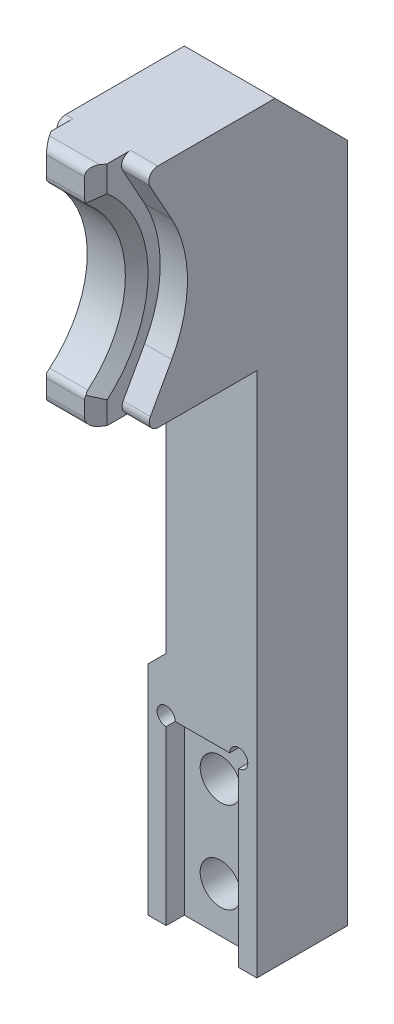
ISO-10303-21;
HEADER;
FILE_DESCRIPTION(('STEP AP214'),'2;1');
FILE_NAME('part.step','',(''),(''),'','','');
FILE_SCHEMA(('AUTOMOTIVE_DESIGN { 1 0 10303 214 1 1 1 1 }'));
ENDSEC;
DATA;
#1=APPLICATION_CONTEXT('core data for automotive mechanical design processes');
#2=APPLICATION_PROTOCOL_DEFINITION('international standard','automotive_design',2000,#1);
#3=PRODUCT_CONTEXT('',#1,'mechanical');
#4=PRODUCT('Part','Part','',(#3));
#5=PRODUCT_RELATED_PRODUCT_CATEGORY('part','',(#4));
#6=PRODUCT_DEFINITION_FORMATION('','',#4);
#7=PRODUCT_DEFINITION_CONTEXT('part definition',#1,'design');
#8=PRODUCT_DEFINITION('design','',#6,#7);
#9=PRODUCT_DEFINITION_SHAPE('','',#8);
#10=(LENGTH_UNIT() NAMED_UNIT(*) SI_UNIT(.MILLI.,.METRE.));
#11=(NAMED_UNIT(*) PLANE_ANGLE_UNIT() SI_UNIT($,.RADIAN.));
#12=(NAMED_UNIT(*) SI_UNIT($,.STERADIAN.) SOLID_ANGLE_UNIT());
#13=UNCERTAINTY_MEASURE_WITH_UNIT(LENGTH_MEASURE(1.E-05),#10,'distance_accuracy_value','');
#14=(GEOMETRIC_REPRESENTATION_CONTEXT(3) GLOBAL_UNCERTAINTY_ASSIGNED_CONTEXT((#13)) GLOBAL_UNIT_ASSIGNED_CONTEXT((#10,
#11,#12)) REPRESENTATION_CONTEXT('',''));
#15=CARTESIAN_POINT('',(0.,0.,0.));
#16=DIRECTION('',(0.,0.,1.));
#17=DIRECTION('',(1.,0.,0.));
#18=AXIS2_PLACEMENT_3D('',#15,#16,#17);
#19=CARTESIAN_POINT('',(0.,0.,-24.));
#20=DIRECTION('',(0.,0.,-1.));
#21=DIRECTION('',(1.,0.,0.));
#22=AXIS2_PLACEMENT_3D('',#19,#20,#21);
#23=PLANE('',#22);
#24=CARTESIAN_POINT('',(4.,-55.3,-24.));
#25=DIRECTION('',(0.,0.,1.));
#26=DIRECTION('',(1.,0.,0.));
#27=AXIS2_PLACEMENT_3D('',#24,#25,#26);
#28=CIRCLE('',#27,2.25);
#29=CARTESIAN_POINT('',(6.25,-55.3,-24.));
#30=VERTEX_POINT('',#29);
#31=EDGE_CURVE('E370',#30,#30,#28,.T.);
#32=ORIENTED_EDGE('',*,*,#31,.F.);
#33=EDGE_LOOP('',(#32));
#34=FACE_BOUND('',#33,.T.);
#35=CARTESIAN_POINT('',(4.,-65.3,-24.));
#36=DIRECTION('',(0.,0.,1.));
#37=DIRECTION('',(1.,0.,0.));
#38=AXIS2_PLACEMENT_3D('',#35,#36,#37);
#39=CIRCLE('',#38,2.25);
#40=CARTESIAN_POINT('',(6.25,-65.3,-24.));
#41=VERTEX_POINT('',#40);
#42=EDGE_CURVE('E380',#41,#41,#39,.T.);
#43=ORIENTED_EDGE('',*,*,#42,.F.);
#44=EDGE_LOOP('',(#43));
#45=FACE_BOUND('',#44,.T.);
#46=CARTESIAN_POINT('',(8.,-50.3,-24.));
#47=DIRECTION('',(0.,0.,-1.));
#48=DIRECTION('',(-1.,0.,0.));
#49=AXIS2_PLACEMENT_3D('',#46,#47,#48);
#50=CIRCLE('',#49,0.999999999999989);
#51=CARTESIAN_POINT('',(8.,-51.3,-24.));
#52=VERTEX_POINT('',#51);
#53=CARTESIAN_POINT('',(7.,-50.3,-24.));
#54=VERTEX_POINT('',#53);
#55=EDGE_CURVE('E349',#52,#54,#50,.T.);
#56=ORIENTED_EDGE('',*,*,#55,.T.);
#57=DIRECTION('',(1.,0.,0.));
#58=VECTOR('',#57,1.);
#59=CARTESIAN_POINT('',(8.,-50.3,-24.));
#60=LINE('',#59,#58);
#61=CARTESIAN_POINT('',(1.,-50.3,-24.));
#62=VERTEX_POINT('',#61);
#63=EDGE_CURVE('E399',#62,#54,#60,.T.);
#64=ORIENTED_EDGE('',*,*,#63,.F.);
#65=CARTESIAN_POINT('',(0.,-50.3,-24.));
#66=DIRECTION('',(0.,0.,-1.));
#67=DIRECTION('',(-1.,0.,0.));
#68=AXIS2_PLACEMENT_3D('',#65,#66,#67);
#69=CIRCLE('',#68,0.999999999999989);
#70=CARTESIAN_POINT('',(0.,-51.3,-24.));
#71=VERTEX_POINT('',#70);
#72=EDGE_CURVE('E355',#62,#71,#69,.T.);
#73=ORIENTED_EDGE('',*,*,#72,.T.);
#74=DIRECTION('',(0.,1.,0.));
#75=VECTOR('',#74,1.);
#76=CARTESIAN_POINT('',(0.,-70.3,-24.));
#77=LINE('',#76,#75);
#78=CARTESIAN_POINT('',(0.,-70.3,-24.));
#79=VERTEX_POINT('',#78);
#80=EDGE_CURVE('E396',#79,#71,#77,.T.);
#81=ORIENTED_EDGE('',*,*,#80,.F.);
#82=DIRECTION('',(-1.,0.,0.));
#83=VECTOR('',#82,1.);
#84=CARTESIAN_POINT('',(8.,-70.3,-24.));
#85=LINE('',#84,#83);
#86=CARTESIAN_POINT('',(8.,-70.3,-24.));
#87=VERTEX_POINT('',#86);
#88=EDGE_CURVE('E406',#87,#79,#85,.T.);
#89=ORIENTED_EDGE('',*,*,#88,.F.);
#90=DIRECTION('',(0.,-1.,0.));
#91=VECTOR('',#90,1.);
#92=CARTESIAN_POINT('',(8.,-70.3,-24.));
#93=LINE('',#92,#91);
#94=EDGE_CURVE('E403',#52,#87,#93,.T.);
#95=ORIENTED_EDGE('',*,*,#94,.F.);
#96=EDGE_LOOP('',(#56,#64,#73,#81,#89,#95));
#97=FACE_BOUND('',#96,.T.);
#98=ADVANCED_FACE('F16',(#34,#45,#97),#23,.F.);
#99=CARTESIAN_POINT('',(0.,0.,0.));
#100=DIRECTION('',(-1.,0.,0.));
#101=DIRECTION('',(0.,0.,-1.));
#102=AXIS2_PLACEMENT_3D('',#99,#100,#101);
#103=PLANE('',#102);
#104=DIRECTION('',(0.,0.,-1.));
#105=VECTOR('',#104,1.);
#106=CARTESIAN_POINT('',(0.,12.7,-4.));
#107=LINE('',#106,#105);
#108=CARTESIAN_POINT('',(0.,12.7,-10.9126633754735));
#109=VERTEX_POINT('',#108);
#110=CARTESIAN_POINT('',(0.,12.7,-24.));
#111=VERTEX_POINT('',#110);
#112=EDGE_CURVE('E715',#109,#111,#107,.T.);
#113=ORIENTED_EDGE('',*,*,#112,.T.);
#114=DIRECTION('',(0.,0.707106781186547,0.707106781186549));
#115=VECTOR('',#114,1.);
#116=CARTESIAN_POINT('',(0.,18.35,-18.35));
#117=LINE('',#116,#115);
#118=CARTESIAN_POINT('',(0.,4.7,-32.));
#119=VERTEX_POINT('',#118);
#120=EDGE_CURVE('E708',#119,#111,#117,.T.);
#121=ORIENTED_EDGE('',*,*,#120,.F.);
#122=DIRECTION('',(0.,-1.,0.));
#123=VECTOR('',#122,1.);
#124=CARTESIAN_POINT('',(0.,12.7,-32.));
#125=LINE('',#124,#123);
#126=CARTESIAN_POINT('',(0.,-44.3,-32.));
#127=VERTEX_POINT('',#126);
#128=EDGE_CURVE('E462',#119,#127,#125,.T.);
#129=ORIENTED_EDGE('',*,*,#128,.T.);
#130=DIRECTION('',(0.,0.,-1.));
#131=VECTOR('',#130,1.);
#132=CARTESIAN_POINT('',(0.,-44.3,-3.999975));
#133=LINE('',#132,#131);
#134=CARTESIAN_POINT('',(0.,-44.3,-22.));
#135=VERTEX_POINT('',#134);
#136=EDGE_CURVE('E346',#135,#127,#133,.T.);
#137=ORIENTED_EDGE('',*,*,#136,.F.);
#138=DIRECTION('',(0.,1.,0.));
#139=VECTOR('',#138,1.);
#140=CARTESIAN_POINT('',(0.,-70.3,-22.));
#141=LINE('',#140,#139);
#142=CARTESIAN_POINT('',(0.,-12.3,-22.));
#143=VERTEX_POINT('',#142);
#144=EDGE_CURVE('E443',#135,#143,#141,.T.);
#145=ORIENTED_EDGE('',*,*,#144,.T.);
#146=DIRECTION('',(0.,0.,1.));
#147=VECTOR('',#146,1.);
#148=CARTESIAN_POINT('',(0.,-12.3,-4.));
#149=LINE('',#148,#147);
#150=CARTESIAN_POINT('',(0.,-12.3,-10.9691106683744));
#151=VERTEX_POINT('',#150);
#152=EDGE_CURVE('E452',#143,#151,#149,.T.);
#153=ORIENTED_EDGE('',*,*,#152,.T.);
#154=CARTESIAN_POINT('',(0.,-11.3,-10.9691106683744));
#155=DIRECTION('',(1.,0.,0.));
#156=DIRECTION('',(0.,0.,-1.));
#157=AXIS2_PLACEMENT_3D('',#154,#155,#156);
#158=CIRCLE('',#157,1.);
#159=CARTESIAN_POINT('',(0.,-10.8084398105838,-10.0982670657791));
#160=VERTEX_POINT('',#159);
#161=EDGE_CURVE('E747',#160,#151,#158,.T.);
#162=ORIENTED_EDGE('',*,*,#161,.F.);
#163=DIRECTION('',(0.,0.870843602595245,-0.491560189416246));
#164=VECTOR('',#163,1.);
#165=CARTESIAN_POINT('',(0.,-6.60895336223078,-12.4687275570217));
#166=LINE('',#165,#164);
#167=CARTESIAN_POINT('',(0.,-6.60895336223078,-12.4687275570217));
#168=VERTEX_POINT('',#167);
#169=EDGE_CURVE('E303',#160,#168,#166,.T.);
#170=ORIENTED_EDGE('',*,*,#169,.T.);
#171=CARTESIAN_POINT('',(0.,0.149999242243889,-0.494628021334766));
#172=DIRECTION('',(1.,0.,0.));
#173=DIRECTION('',(0.,0.,-1.));
#174=AXIS2_PLACEMENT_3D('',#171,#172,#173);
#175=CIRCLE('',#174,13.7500000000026);
#176=CARTESIAN_POINT('',(0.,6.90895184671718,-12.4687275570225));
#177=VERTEX_POINT('',#176);
#178=EDGE_CURVE('E277',#168,#177,#175,.T.);
#179=ORIENTED_EDGE('',*,*,#178,.T.);
#180=DIRECTION('',(0.,0.870843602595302,0.491560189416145));
#181=VECTOR('',#180,1.);
#182=CARTESIAN_POINT('',(0.,12.7,-9.19988718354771));
#183=LINE('',#182,#181);
#184=CARTESIAN_POINT('',(0.,11.2084398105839,-10.0418197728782));
#185=VERTEX_POINT('',#184);
#186=EDGE_CURVE('E307',#177,#185,#183,.T.);
#187=ORIENTED_EDGE('',*,*,#186,.T.);
#188=CARTESIAN_POINT('',(0.,11.7,-10.9126633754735));
#189=DIRECTION('',(1.,0.,0.));
#190=DIRECTION('',(0.,0.,-1.));
#191=AXIS2_PLACEMENT_3D('',#188,#189,#190);
#192=CIRCLE('',#191,1.);
#193=EDGE_CURVE('E748',#109,#185,#192,.T.);
#194=ORIENTED_EDGE('',*,*,#193,.F.);
#195=EDGE_LOOP('',(#113,#121,#129,#137,#145,#153,#162,#170,#179,#187,#194));
#196=FACE_BOUND('',#195,.T.);
#197=ADVANCED_FACE('F643',(#196),#103,.T.);
#198=CARTESIAN_POINT('',(23.2,-12.3,-4.));
#199=DIRECTION('',(0.,1.,0.));
#200=DIRECTION('',(0.,0.,-1.));
#201=AXIS2_PLACEMENT_3D('',#198,#199,#200);
#202=PLANE('',#201);
#203=ORIENTED_EDGE('',*,*,#152,.F.);
#204=DIRECTION('',(1.,0.,0.));
#205=VECTOR('',#204,1.);
#206=CARTESIAN_POINT('',(0.,-12.3,-22.));
#207=LINE('',#206,#205);
#208=CARTESIAN_POINT('',(10.,-12.3,-22.));
#209=VERTEX_POINT('',#208);
#210=EDGE_CURVE('E435',#143,#209,#207,.T.);
#211=ORIENTED_EDGE('',*,*,#210,.T.);
#212=DIRECTION('',(0.,0.,1.));
#213=VECTOR('',#212,1.);
#214=CARTESIAN_POINT('',(10.,-12.3,-22.));
#215=LINE('',#214,#213);
#216=CARTESIAN_POINT('',(10.,-12.3,-11.1339663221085));
#217=VERTEX_POINT('',#216);
#218=EDGE_CURVE('E337',#209,#217,#215,.T.);
#219=ORIENTED_EDGE('',*,*,#218,.T.);
#220=DIRECTION('',(1.,0.,0.));
#221=VECTOR('',#220,1.);
#222=CARTESIAN_POINT('',(23.2,-12.3,-11.1339663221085));
#223=LINE('',#222,#221);
#224=CARTESIAN_POINT('',(7.,-12.3,-11.1339663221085));
#225=VERTEX_POINT('',#224);
#226=EDGE_CURVE('E759',#225,#217,#223,.T.);
#227=ORIENTED_EDGE('',*,*,#226,.F.);
#228=DIRECTION('',(0.,0.,1.));
#229=VECTOR('',#228,1.);
#230=CARTESIAN_POINT('',(7.,-12.3,-9.43887100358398));
#231=LINE('',#230,#229);
#232=CARTESIAN_POINT('',(7.,-12.3,-8.5));
#233=VERTEX_POINT('',#232);
#234=EDGE_CURVE('E318',#225,#233,#231,.T.);
#235=ORIENTED_EDGE('',*,*,#234,.T.);
#236=DIRECTION('',(0.554700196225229,0.,-0.832050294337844));
#237=VECTOR('',#236,1.);
#238=CARTESIAN_POINT('',(6.,-12.3,-7.));
#239=LINE('',#238,#237);
#240=CARTESIAN_POINT('',(6.66666666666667,-12.3,-8.));
#241=VERTEX_POINT('',#240);
#242=EDGE_CURVE('E508',#241,#233,#239,.T.);
#243=ORIENTED_EDGE('',*,*,#242,.F.);
#244=DIRECTION('',(-1.,0.,0.));
#245=VECTOR('',#244,1.);
#246=CARTESIAN_POINT('',(23.2,-12.3,-8.));
#247=LINE('',#246,#245);
#248=CARTESIAN_POINT('',(1.13333333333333,-12.3,-8.));
#249=VERTEX_POINT('',#248);
#250=EDGE_CURVE('E745',#249,#241,#247,.F.);
#251=ORIENTED_EDGE('',*,*,#250,.F.);
#252=DIRECTION('',(0.554700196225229,0.,0.832050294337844));
#253=VECTOR('',#252,1.);
#254=CARTESIAN_POINT('',(1.8,-12.3,-7.));
#255=LINE('',#254,#253);
#256=CARTESIAN_POINT('',(0.8,-12.3,-8.5));
#257=VERTEX_POINT('',#256);
#258=EDGE_CURVE('E511',#257,#249,#255,.T.);
#259=ORIENTED_EDGE('',*,*,#258,.F.);
#260=DIRECTION('',(0.,0.,-1.));
#261=VECTOR('',#260,1.);
#262=CARTESIAN_POINT('',(0.8,-12.3,-3.47291636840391));
#263=LINE('',#262,#261);
#264=CARTESIAN_POINT('',(0.8,-12.3,-10.9691106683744));
#265=VERTEX_POINT('',#264);
#266=EDGE_CURVE('E290',#257,#265,#263,.T.);
#267=ORIENTED_EDGE('',*,*,#266,.T.);
#268=DIRECTION('',(-1.,0.,0.));
#269=VECTOR('',#268,1.);
#270=CARTESIAN_POINT('',(23.2,-12.3,-10.9691106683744));
#271=LINE('',#270,#269);
#272=EDGE_CURVE('E739',#151,#265,#271,.F.);
#273=ORIENTED_EDGE('',*,*,#272,.F.);
#274=EDGE_LOOP('',(#203,#211,#219,#227,#235,#243,#251,#259,#267,#273));
#275=FACE_BOUND('',#274,.T.);
#276=ADVANCED_FACE('F650',(#275),#202,.F.);
#277=CARTESIAN_POINT('',(0.,12.7,0.));
#278=DIRECTION('',(0.,1.,0.));
#279=DIRECTION('',(0.,0.,-1.));
#280=AXIS2_PLACEMENT_3D('',#277,#278,#279);
#281=PLANE('',#280);
#282=DIRECTION('',(0.,0.,1.));
#283=VECTOR('',#282,1.);
#284=CARTESIAN_POINT('',(0.8,12.7,-3.47291636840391));
#285=LINE('',#284,#283);
#286=CARTESIAN_POINT('',(0.8,12.7,-10.9126633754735));
#287=VERTEX_POINT('',#286);
#288=CARTESIAN_POINT('',(0.8,12.7,-8.5));
#289=VERTEX_POINT('',#288);
#290=EDGE_CURVE('E282',#287,#289,#285,.T.);
#291=ORIENTED_EDGE('',*,*,#290,.T.);
#292=DIRECTION('',(-0.554700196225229,0.,-0.832050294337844));
#293=VECTOR('',#292,1.);
#294=CARTESIAN_POINT('',(4.47692307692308,12.7,-2.98461538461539));
#295=LINE('',#294,#293);
#296=CARTESIAN_POINT('',(1.13333333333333,12.7,-8.));
#297=VERTEX_POINT('',#296);
#298=EDGE_CURVE('E485',#297,#289,#295,.T.);
#299=ORIENTED_EDGE('',*,*,#298,.F.);
#300=DIRECTION('',(-1.,0.,0.));
#301=VECTOR('',#300,1.);
#302=CARTESIAN_POINT('',(1.8,12.7,-8.));
#303=LINE('',#302,#301);
#304=CARTESIAN_POINT('',(6.66666666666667,12.7,-8.));
#305=VERTEX_POINT('',#304);
#306=EDGE_CURVE('E754',#305,#297,#303,.T.);
#307=ORIENTED_EDGE('',*,*,#306,.F.);
#308=DIRECTION('',(-0.554700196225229,0.,0.832050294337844));
#309=VECTOR('',#308,1.);
#310=CARTESIAN_POINT('',(0.923076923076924,12.7,0.615384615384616));
#311=LINE('',#310,#309);
#312=CARTESIAN_POINT('',(7.,12.7,-8.5));
#313=VERTEX_POINT('',#312);
#314=EDGE_CURVE('E482',#313,#305,#311,.T.);
#315=ORIENTED_EDGE('',*,*,#314,.F.);
#316=DIRECTION('',(0.,0.,-1.));
#317=VECTOR('',#316,1.);
#318=CARTESIAN_POINT('',(7.,12.7,-3.88361226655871));
#319=LINE('',#318,#317);
#320=CARTESIAN_POINT('',(7.,12.7,-11.0787075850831));
#321=VERTEX_POINT('',#320);
#322=EDGE_CURVE('E321',#313,#321,#319,.T.);
#323=ORIENTED_EDGE('',*,*,#322,.T.);
#324=DIRECTION('',(1.,0.,0.));
#325=VECTOR('',#324,1.);
#326=CARTESIAN_POINT('',(7.,12.7,-11.0787075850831));
#327=LINE('',#326,#325);
#328=CARTESIAN_POINT('',(10.,12.7,-11.0787075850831));
#329=VERTEX_POINT('',#328);
#330=EDGE_CURVE('E522',#329,#321,#327,.F.);
#331=ORIENTED_EDGE('',*,*,#330,.F.);
#332=DIRECTION('',(0.,0.,-1.));
#333=VECTOR('',#332,1.);
#334=CARTESIAN_POINT('',(10.,12.7,-4.));
#335=LINE('',#334,#333);
#336=CARTESIAN_POINT('',(10.,12.7,-24.));
#337=VERTEX_POINT('',#336);
#338=EDGE_CURVE('E341',#329,#337,#335,.T.);
#339=ORIENTED_EDGE('',*,*,#338,.T.);
#340=DIRECTION('',(1.,0.,0.));
#341=VECTOR('',#340,1.);
#342=CARTESIAN_POINT('',(8.,12.7,-24.));
#343=LINE('',#342,#341);
#344=EDGE_CURVE('E472',#111,#337,#343,.T.);
#345=ORIENTED_EDGE('',*,*,#344,.F.);
#346=ORIENTED_EDGE('',*,*,#112,.F.);
#347=DIRECTION('',(-1.,0.,0.));
#348=VECTOR('',#347,1.);
#349=CARTESIAN_POINT('',(0.,12.7,-10.9126633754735));
#350=LINE('',#349,#348);
#351=EDGE_CURVE('E749',#287,#109,#350,.T.);
#352=ORIENTED_EDGE('',*,*,#351,.F.);
#353=EDGE_LOOP('',(#291,#299,#307,#315,#323,#331,#339,#345,#346,#352));
#354=FACE_BOUND('',#353,.T.);
#355=ADVANCED_FACE('F691',(#354),#281,.T.);
#356=CARTESIAN_POINT('',(19.2,12.7,-32.));
#357=DIRECTION('',(0.,0.,1.));
#358=DIRECTION('',(-1.,0.,0.));
#359=AXIS2_PLACEMENT_3D('',#356,#357,#358);
#360=PLANE('',#359);
#361=CARTESIAN_POINT('',(4.,-55.3,-32.));
#362=DIRECTION('',(0.,0.,1.));
#363=DIRECTION('',(1.,0.,0.));
#364=AXIS2_PLACEMENT_3D('',#361,#362,#363);
#365=CIRCLE('',#364,4.);
#366=CARTESIAN_POINT('',(8.,-55.3,-32.));
#367=VERTEX_POINT('',#366);
#368=EDGE_CURVE('E361',#367,#367,#365,.T.);
#369=ORIENTED_EDGE('',*,*,#368,.T.);
#370=EDGE_LOOP('',(#369));
#371=FACE_BOUND('',#370,.T.);
#372=CARTESIAN_POINT('',(4.,-65.3,-32.));
#373=DIRECTION('',(0.,0.,1.));
#374=DIRECTION('',(1.,0.,0.));
#375=AXIS2_PLACEMENT_3D('',#372,#373,#374);
#376=CIRCLE('',#375,4.);
#377=CARTESIAN_POINT('',(8.,-65.3,-32.));
#378=VERTEX_POINT('',#377);
#379=EDGE_CURVE('E371',#378,#378,#376,.T.);
#380=ORIENTED_EDGE('',*,*,#379,.T.);
#381=EDGE_LOOP('',(#380));
#382=FACE_BOUND('',#381,.T.);
#383=ORIENTED_EDGE('',*,*,#128,.F.);
#384=DIRECTION('',(-1.,0.,0.));
#385=VECTOR('',#384,1.);
#386=CARTESIAN_POINT('',(0.,4.7,-32.));
#387=LINE('',#386,#385);
#388=CARTESIAN_POINT('',(10.,4.7,-32.));
#389=VERTEX_POINT('',#388);
#390=EDGE_CURVE('E456',#389,#119,#387,.T.);
#391=ORIENTED_EDGE('',*,*,#390,.F.);
#392=DIRECTION('',(0.,1.,0.));
#393=VECTOR('',#392,1.);
#394=CARTESIAN_POINT('',(10.,-70.3,-32.));
#395=LINE('',#394,#393);
#396=CARTESIAN_POINT('',(10.,-70.3,-32.));
#397=VERTEX_POINT('',#396);
#398=EDGE_CURVE('E419',#397,#389,#395,.T.);
#399=ORIENTED_EDGE('',*,*,#398,.F.);
#400=DIRECTION('',(-1.,0.,0.));
#401=VECTOR('',#400,1.);
#402=CARTESIAN_POINT('',(0.,-70.3,-32.));
#403=LINE('',#402,#401);
#404=CARTESIAN_POINT('',(-2.,-70.3,-32.));
#405=VERTEX_POINT('',#404);
#406=EDGE_CURVE('E439',#397,#405,#403,.T.);
#407=ORIENTED_EDGE('',*,*,#406,.T.);
#408=DIRECTION('',(0.,-1.,0.));
#409=VECTOR('',#408,1.);
#410=CARTESIAN_POINT('',(-2.,-38.3,-32.));
#411=LINE('',#410,#409);
#412=CARTESIAN_POINT('',(-2.,-46.3,-32.));
#413=VERTEX_POINT('',#412);
#414=EDGE_CURVE('E427',#413,#405,#411,.T.);
#415=ORIENTED_EDGE('',*,*,#414,.F.);
#416=DIRECTION('',(-0.707106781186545,-0.70710678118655,0.));
#417=VECTOR('',#416,1.);
#418=CARTESIAN_POINT('',(0.,-44.3,-32.));
#419=LINE('',#418,#417);
#420=EDGE_CURVE('E468',#127,#413,#419,.T.);
#421=ORIENTED_EDGE('',*,*,#420,.F.);
#422=EDGE_LOOP('',(#383,#391,#399,#407,#415,#421));
#423=FACE_BOUND('',#422,.T.);
#424=ADVANCED_FACE('F687',(#371,#382,#423),#360,.F.);
#425=CARTESIAN_POINT('',(0.,-70.3,-22.));
#426=DIRECTION('',(0.,0.,-1.));
#427=DIRECTION('',(1.,0.,0.));
#428=AXIS2_PLACEMENT_3D('',#425,#426,#427);
#429=PLANE('',#428);
#430=DIRECTION('',(0.,-1.,0.));
#431=VECTOR('',#430,1.);
#432=CARTESIAN_POINT('',(-2.,-38.3,-22.));
#433=LINE('',#432,#431);
#434=CARTESIAN_POINT('',(-2.,-46.3,-22.));
#435=VERTEX_POINT('',#434);
#436=CARTESIAN_POINT('',(-2.,-70.3,-22.));
#437=VERTEX_POINT('',#436);
#438=EDGE_CURVE('E428',#435,#437,#433,.T.);
#439=ORIENTED_EDGE('',*,*,#438,.T.);
#440=DIRECTION('',(1.,0.,0.));
#441=VECTOR('',#440,1.);
#442=CARTESIAN_POINT('',(0.,-70.3,-22.));
#443=LINE('',#442,#441);
#444=CARTESIAN_POINT('',(0.,-70.3,-22.));
#445=VERTEX_POINT('',#444);
#446=EDGE_CURVE('E436',#437,#445,#443,.T.);
#447=ORIENTED_EDGE('',*,*,#446,.T.);
#448=DIRECTION('',(0.,1.,0.));
#449=VECTOR('',#448,1.);
#450=CARTESIAN_POINT('',(0.,-70.3,-22.));
#451=LINE('',#450,#449);
#452=CARTESIAN_POINT('',(0.,-51.3,-22.));
#453=VERTEX_POINT('',#452);
#454=EDGE_CURVE('E395',#445,#453,#451,.T.);
#455=ORIENTED_EDGE('',*,*,#454,.T.);
#456=CARTESIAN_POINT('',(0.,-50.3,-22.));
#457=DIRECTION('',(0.,0.,-1.));
#458=DIRECTION('',(-1.,0.,0.));
#459=AXIS2_PLACEMENT_3D('',#456,#457,#458);
#460=CIRCLE('',#459,1.);
#461=CARTESIAN_POINT('',(1.,-50.3,-22.));
#462=VERTEX_POINT('',#461);
#463=EDGE_CURVE('E381',#453,#462,#460,.T.);
#464=ORIENTED_EDGE('',*,*,#463,.T.);
#465=DIRECTION('',(1.,0.,0.));
#466=VECTOR('',#465,1.);
#467=CARTESIAN_POINT('',(8.,-50.3,-22.));
#468=LINE('',#467,#466);
#469=CARTESIAN_POINT('',(7.,-50.3,-22.));
#470=VERTEX_POINT('',#469);
#471=EDGE_CURVE('E412',#462,#470,#468,.T.);
#472=ORIENTED_EDGE('',*,*,#471,.T.);
#473=CARTESIAN_POINT('',(8.,-50.3,-22.));
#474=DIRECTION('',(0.,0.,-1.));
#475=DIRECTION('',(-1.,0.,0.));
#476=AXIS2_PLACEMENT_3D('',#473,#474,#475);
#477=CIRCLE('',#476,1.);
#478=CARTESIAN_POINT('',(8.,-51.3,-22.));
#479=VERTEX_POINT('',#478);
#480=EDGE_CURVE('E388',#470,#479,#477,.T.);
#481=ORIENTED_EDGE('',*,*,#480,.T.);
#482=DIRECTION('',(0.,-1.,0.));
#483=VECTOR('',#482,1.);
#484=CARTESIAN_POINT('',(8.,-70.3,-22.));
#485=LINE('',#484,#483);
#486=CARTESIAN_POINT('',(8.,-70.3,-22.));
#487=VERTEX_POINT('',#486);
#488=EDGE_CURVE('E400',#479,#487,#485,.T.);
#489=ORIENTED_EDGE('',*,*,#488,.T.);
#490=CARTESIAN_POINT('',(10.,-70.3,-22.));
#491=VERTEX_POINT('',#490);
#492=EDGE_CURVE('E440',#487,#491,#443,.T.);
#493=ORIENTED_EDGE('',*,*,#492,.T.);
#494=DIRECTION('',(0.,1.,0.));
#495=VECTOR('',#494,1.);
#496=CARTESIAN_POINT('',(10.,-70.3,-22.));
#497=LINE('',#496,#495);
#498=EDGE_CURVE('E421',#491,#209,#497,.T.);
#499=ORIENTED_EDGE('',*,*,#498,.T.);
#500=ORIENTED_EDGE('',*,*,#210,.F.);
#501=ORIENTED_EDGE('',*,*,#144,.F.);
#502=DIRECTION('',(0.707106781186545,0.70710678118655,0.));
#503=VECTOR('',#502,1.);
#504=CARTESIAN_POINT('',(0.,-44.3,-22.));
#505=LINE('',#504,#503);
#506=EDGE_CURVE('E474',#435,#135,#505,.T.);
#507=ORIENTED_EDGE('',*,*,#506,.F.);
#508=EDGE_LOOP('',(#439,#447,#455,#464,#472,#481,#489,#493,#499,#500,#501,#507));
#509=FACE_BOUND('',#508,.T.);
#510=ADVANCED_FACE('F683',(#509),#429,.F.);
#511=CARTESIAN_POINT('',(0.,-70.3,0.));
#512=DIRECTION('',(0.,-1.,0.));
#513=DIRECTION('',(0.,0.,1.));
#514=AXIS2_PLACEMENT_3D('',#511,#512,#513);
#515=PLANE('',#514);
#516=DIRECTION('',(0.,0.,1.));
#517=VECTOR('',#516,1.);
#518=CARTESIAN_POINT('',(0.,-70.3,-24.));
#519=LINE('',#518,#517);
#520=EDGE_CURVE('E417',#79,#445,#519,.T.);
#521=ORIENTED_EDGE('',*,*,#520,.T.);
#522=ORIENTED_EDGE('',*,*,#446,.F.);
#523=DIRECTION('',(0.,0.,-1.));
#524=VECTOR('',#523,1.);
#525=CARTESIAN_POINT('',(-2.,-70.3,-22.));
#526=LINE('',#525,#524);
#527=EDGE_CURVE('E431',#437,#405,#526,.T.);
#528=ORIENTED_EDGE('',*,*,#527,.T.);
#529=ORIENTED_EDGE('',*,*,#406,.F.);
#530=DIRECTION('',(0.,0.,-1.));
#531=VECTOR('',#530,1.);
#532=CARTESIAN_POINT('',(10.,-70.3,-22.));
#533=LINE('',#532,#531);
#534=EDGE_CURVE('E423',#491,#397,#533,.T.);
#535=ORIENTED_EDGE('',*,*,#534,.F.);
#536=ORIENTED_EDGE('',*,*,#492,.F.);
#537=DIRECTION('',(0.,0.,1.));
#538=VECTOR('',#537,1.);
#539=CARTESIAN_POINT('',(8.,-70.3,-24.));
#540=LINE('',#539,#538);
#541=EDGE_CURVE('E409',#87,#487,#540,.T.);
#542=ORIENTED_EDGE('',*,*,#541,.F.);
#543=ORIENTED_EDGE('',*,*,#88,.T.);
#544=EDGE_LOOP('',(#521,#522,#528,#529,#535,#536,#542,#543));
#545=FACE_BOUND('',#544,.T.);
#546=ADVANCED_FACE('F680',(#545),#515,.T.);
#547=CARTESIAN_POINT('',(19.2,4.7,-32.));
#548=DIRECTION('',(0.,0.707106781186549,-0.707106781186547));
#549=DIRECTION('',(1.,0.,0.));
#550=AXIS2_PLACEMENT_3D('',#547,#548,#549);
#551=PLANE('',#550);
#552=ORIENTED_EDGE('',*,*,#390,.T.);
#553=ORIENTED_EDGE('',*,*,#120,.T.);
#554=ORIENTED_EDGE('',*,*,#344,.T.);
#555=DIRECTION('',(0.,-0.707106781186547,-0.707106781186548));
#556=VECTOR('',#555,1.);
#557=CARTESIAN_POINT('',(10.,12.7,-24.));
#558=LINE('',#557,#556);
#559=EDGE_CURVE('E344',#337,#389,#558,.T.);
#560=ORIENTED_EDGE('',*,*,#559,.T.);
#561=EDGE_LOOP('',(#552,#553,#554,#560));
#562=FACE_BOUND('',#561,.T.);
#563=ADVANCED_FACE('F678',(#562),#551,.T.);
#564=CARTESIAN_POINT('',(-2.,-38.3,-22.));
#565=DIRECTION('',(-1.,0.,0.));
#566=DIRECTION('',(0.,-1.,0.));
#567=AXIS2_PLACEMENT_3D('',#564,#565,#566);
#568=PLANE('',#567);
#569=ORIENTED_EDGE('',*,*,#414,.T.);
#570=ORIENTED_EDGE('',*,*,#527,.F.);
#571=ORIENTED_EDGE('',*,*,#438,.F.);
#572=DIRECTION('',(0.,0.,1.));
#573=VECTOR('',#572,1.);
#574=CARTESIAN_POINT('',(-2.,-46.3,-22.));
#575=LINE('',#574,#573);
#576=EDGE_CURVE('E471',#413,#435,#575,.T.);
#577=ORIENTED_EDGE('',*,*,#576,.F.);
#578=EDGE_LOOP('',(#569,#570,#571,#577));
#579=FACE_BOUND('',#578,.T.);
#580=ADVANCED_FACE('F674',(#579),#568,.T.);
#581=CARTESIAN_POINT('',(10.,-70.3,-22.));
#582=DIRECTION('',(1.,0.,0.));
#583=DIRECTION('',(0.,0.,1.));
#584=AXIS2_PLACEMENT_3D('',#581,#582,#583);
#585=PLANE('',#584);
#586=DIRECTION('',(0.,-0.875261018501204,-0.483650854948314));
#587=VECTOR('',#586,1.);
#588=CARTESIAN_POINT('',(10.,6.84856358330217,-12.6169931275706));
#589=LINE('',#588,#587);
#590=CARTESIAN_POINT('',(10.,11.2163491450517,-10.2034465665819));
#591=VERTEX_POINT('',#590);
#592=CARTESIAN_POINT('',(10.,6.84856358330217,-12.6169931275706));
#593=VERTEX_POINT('',#592);
#594=EDGE_CURVE('E316',#591,#593,#589,.T.);
#595=ORIENTED_EDGE('',*,*,#594,.T.);
#596=CARTESIAN_POINT('',(10.,0.149999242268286,-0.4946280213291));
#597=DIRECTION('',(-1.,0.,0.));
#598=DIRECTION('',(0.,0.,1.));
#599=AXIS2_PLACEMENT_3D('',#596,#597,#598);
#600=CIRCLE('',#599,13.8499999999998);
#601=CARTESIAN_POINT('',(10.,-6.54856509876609,-12.6169931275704));
#602=VERTEX_POINT('',#601);
#603=EDGE_CURVE('E310',#593,#602,#600,.T.);
#604=ORIENTED_EDGE('',*,*,#603,.T.);
#605=DIRECTION('',(0.,-0.875261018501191,0.483650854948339));
#606=VECTOR('',#605,1.);
#607=CARTESIAN_POINT('',(10.,-6.54856509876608,-12.6169931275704));
#608=LINE('',#607,#606);
#609=CARTESIAN_POINT('',(10.,-10.8163491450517,-10.2587053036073));
#610=VERTEX_POINT('',#609);
#611=EDGE_CURVE('E330',#602,#610,#608,.T.);
#612=ORIENTED_EDGE('',*,*,#611,.T.);
#613=CARTESIAN_POINT('',(10.,-11.3,-11.1339663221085));
#614=DIRECTION('',(-1.,0.,0.));
#615=DIRECTION('',(0.,0.,1.));
#616=AXIS2_PLACEMENT_3D('',#613,#614,#615);
#617=CIRCLE('',#616,1.);
#618=EDGE_CURVE('E815',#217,#610,#617,.T.);
#619=ORIENTED_EDGE('',*,*,#618,.F.);
#620=ORIENTED_EDGE('',*,*,#218,.F.);
#621=ORIENTED_EDGE('',*,*,#498,.F.);
#622=ORIENTED_EDGE('',*,*,#534,.T.);
#623=ORIENTED_EDGE('',*,*,#398,.T.);
#624=ORIENTED_EDGE('',*,*,#559,.F.);
#625=ORIENTED_EDGE('',*,*,#338,.F.);
#626=CARTESIAN_POINT('',(10.,11.7,-11.0787075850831));
#627=DIRECTION('',(-1.,0.,0.));
#628=DIRECTION('',(0.,0.,1.));
#629=AXIS2_PLACEMENT_3D('',#626,#627,#628);
#630=CIRCLE('',#629,1.);
#631=EDGE_CURVE('E722',#591,#329,#630,.T.);
#632=ORIENTED_EDGE('',*,*,#631,.F.);
#633=EDGE_LOOP('',(#595,#604,#612,#619,#620,#621,#622,#623,#624,#625,#632));
#634=FACE_BOUND('',#633,.T.);
#635=ADVANCED_FACE('F670',(#634),#585,.T.);
#636=CARTESIAN_POINT('',(0.,-70.3,-24.));
#637=DIRECTION('',(-1.,0.,0.));
#638=DIRECTION('',(0.,0.,-1.));
#639=AXIS2_PLACEMENT_3D('',#636,#637,#638);
#640=PLANE('',#639);
#641=ORIENTED_EDGE('',*,*,#454,.F.);
#642=ORIENTED_EDGE('',*,*,#520,.F.);
#643=ORIENTED_EDGE('',*,*,#80,.T.);
#644=DIRECTION('',(0.,0.,1.));
#645=VECTOR('',#644,1.);
#646=CARTESIAN_POINT('',(0.,-51.3,-24.));
#647=LINE('',#646,#645);
#648=EDGE_CURVE('E386',#453,#71,#647,.F.);
#649=ORIENTED_EDGE('',*,*,#648,.F.);
#650=EDGE_LOOP('',(#641,#642,#643,#649));
#651=FACE_BOUND('',#650,.T.);
#652=ADVANCED_FACE('F663',(#651),#640,.F.);
#653=CARTESIAN_POINT('',(8.,-70.3,-24.));
#654=DIRECTION('',(1.,0.,0.));
#655=DIRECTION('',(0.,0.,1.));
#656=AXIS2_PLACEMENT_3D('',#653,#654,#655);
#657=PLANE('',#656);
#658=ORIENTED_EDGE('',*,*,#94,.T.);
#659=ORIENTED_EDGE('',*,*,#541,.T.);
#660=ORIENTED_EDGE('',*,*,#488,.F.);
#661=DIRECTION('',(0.,0.,1.));
#662=VECTOR('',#661,1.);
#663=CARTESIAN_POINT('',(8.,-51.3,-24.));
#664=LINE('',#663,#662);
#665=EDGE_CURVE('E393',#52,#479,#664,.T.);
#666=ORIENTED_EDGE('',*,*,#665,.F.);
#667=EDGE_LOOP('',(#658,#659,#660,#666));
#668=FACE_BOUND('',#667,.T.);
#669=ADVANCED_FACE('F659',(#668),#657,.F.);
#670=CARTESIAN_POINT('',(8.,-50.3,-24.));
#671=DIRECTION('',(0.,1.,0.));
#672=DIRECTION('',(0.,0.,-1.));
#673=AXIS2_PLACEMENT_3D('',#670,#671,#672);
#674=PLANE('',#673);
#675=ORIENTED_EDGE('',*,*,#63,.T.);
#676=DIRECTION('',(0.,0.,1.));
#677=VECTOR('',#676,1.);
#678=CARTESIAN_POINT('',(7.,-50.3,-24.));
#679=LINE('',#678,#677);
#680=EDGE_CURVE('E391',#470,#54,#679,.F.);
#681=ORIENTED_EDGE('',*,*,#680,.F.);
#682=ORIENTED_EDGE('',*,*,#471,.F.);
#683=DIRECTION('',(0.,0.,1.));
#684=VECTOR('',#683,1.);
#685=CARTESIAN_POINT('',(1.,-50.3,-24.));
#686=LINE('',#685,#684);
#687=EDGE_CURVE('E384',#62,#462,#686,.T.);
#688=ORIENTED_EDGE('',*,*,#687,.F.);
#689=EDGE_LOOP('',(#675,#681,#682,#688));
#690=FACE_BOUND('',#689,.T.);
#691=ADVANCED_FACE('F662',(#690),#674,.F.);
#692=CARTESIAN_POINT('',(8.,-50.3,-24.));
#693=DIRECTION('',(0.,0.,1.));
#694=DIRECTION('',(-1.,0.,0.));
#695=AXIS2_PLACEMENT_3D('',#692,#693,#694);
#696=CYLINDRICAL_SURFACE('',#695,1.);
#697=ORIENTED_EDGE('',*,*,#665,.T.);
#698=ORIENTED_EDGE('',*,*,#480,.F.);
#699=ORIENTED_EDGE('',*,*,#680,.T.);
#700=ORIENTED_EDGE('',*,*,#55,.F.);
#701=EDGE_LOOP('',(#697,#698,#699,#700));
#702=FACE_BOUND('',#701,.T.);
#703=CARTESIAN_POINT('',(8.,-50.3,-25.));
#704=DIRECTION('',(0.,0.,-1.));
#705=DIRECTION('',(-1.,0.,0.));
#706=AXIS2_PLACEMENT_3D('',#703,#704,#705);
#707=CIRCLE('',#706,1.);
#708=CARTESIAN_POINT('',(7.,-50.3,-25.));
#709=VERTEX_POINT('',#708);
#710=EDGE_CURVE('E352',#709,#709,#707,.T.);
#711=ORIENTED_EDGE('',*,*,#710,.T.);
#712=EDGE_LOOP('',(#711));
#713=FACE_BOUND('',#712,.T.);
#714=ADVANCED_FACE('F657',(#702,#713),#696,.F.);
#715=CARTESIAN_POINT('',(0.,-50.3,-24.));
#716=DIRECTION('',(0.,0.,1.));
#717=DIRECTION('',(-1.,0.,0.));
#718=AXIS2_PLACEMENT_3D('',#715,#716,#717);
#719=CYLINDRICAL_SURFACE('',#718,1.);
#720=ORIENTED_EDGE('',*,*,#463,.F.);
#721=ORIENTED_EDGE('',*,*,#648,.T.);
#722=ORIENTED_EDGE('',*,*,#72,.F.);
#723=ORIENTED_EDGE('',*,*,#687,.T.);
#724=EDGE_LOOP('',(#720,#721,#722,#723));
#725=FACE_BOUND('',#724,.T.);
#726=CARTESIAN_POINT('',(0.,-50.3,-25.));
#727=DIRECTION('',(0.,0.,-1.));
#728=DIRECTION('',(-1.,0.,0.));
#729=AXIS2_PLACEMENT_3D('',#726,#727,#728);
#730=CIRCLE('',#729,1.);
#731=CARTESIAN_POINT('',(-0.999999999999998,-50.3,-25.));
#732=VERTEX_POINT('',#731);
#733=EDGE_CURVE('E358',#732,#732,#730,.T.);
#734=ORIENTED_EDGE('',*,*,#733,.T.);
#735=EDGE_LOOP('',(#734));
#736=FACE_BOUND('',#735,.T.);
#737=ADVANCED_FACE('F881',(#725,#736),#719,.F.);
#738=CARTESIAN_POINT('',(4.,-65.3,-32.));
#739=DIRECTION('',(0.,0.,-1.));
#740=DIRECTION('',(1.,0.,0.));
#741=AXIS2_PLACEMENT_3D('',#738,#739,#740);
#742=CYLINDRICAL_SURFACE('',#741,2.25);
#743=CARTESIAN_POINT('',(4.,-65.3,-27.6));
#744=DIRECTION('',(0.,0.,1.));
#745=DIRECTION('',(1.,0.,0.));
#746=AXIS2_PLACEMENT_3D('',#743,#744,#745);
#747=CIRCLE('',#746,2.25);
#748=CARTESIAN_POINT('',(6.25,-65.3,-27.6));
#749=VERTEX_POINT('',#748);
#750=EDGE_CURVE('E377',#749,#749,#747,.T.);
#751=ORIENTED_EDGE('',*,*,#750,.F.);
#752=EDGE_LOOP('',(#751));
#753=FACE_BOUND('',#752,.T.);
#754=ORIENTED_EDGE('',*,*,#42,.T.);
#755=EDGE_LOOP('',(#754));
#756=FACE_BOUND('',#755,.T.);
#757=ADVANCED_FACE('F878',(#753,#756),#742,.F.);
#758=CARTESIAN_POINT('',(6.25,-65.3,-27.6));
#759=DIRECTION('',(0.,0.,1.));
#760=DIRECTION('',(-1.,0.,0.));
#761=AXIS2_PLACEMENT_3D('',#758,#759,#760);
#762=PLANE('',#761);
#763=ORIENTED_EDGE('',*,*,#750,.T.);
#764=EDGE_LOOP('',(#763));
#765=FACE_BOUND('',#764,.T.);
#766=CARTESIAN_POINT('',(4.,-65.3,-27.6));
#767=DIRECTION('',(0.,0.,1.));
#768=DIRECTION('',(1.,0.,0.));
#769=AXIS2_PLACEMENT_3D('',#766,#767,#768);
#770=CIRCLE('',#769,4.);
#771=CARTESIAN_POINT('',(8.,-65.3,-27.6));
#772=VERTEX_POINT('',#771);
#773=EDGE_CURVE('E374',#772,#772,#770,.T.);
#774=ORIENTED_EDGE('',*,*,#773,.F.);
#775=EDGE_LOOP('',(#774));
#776=FACE_BOUND('',#775,.T.);
#777=ADVANCED_FACE('F874',(#765,#776),#762,.F.);
#778=CARTESIAN_POINT('',(4.,-65.3,-32.));
#779=DIRECTION('',(0.,0.,-1.));
#780=DIRECTION('',(1.,0.,0.));
#781=AXIS2_PLACEMENT_3D('',#778,#779,#780);
#782=CYLINDRICAL_SURFACE('',#781,4.);
#783=ORIENTED_EDGE('',*,*,#773,.T.);
#784=EDGE_LOOP('',(#783));
#785=FACE_BOUND('',#784,.T.);
#786=ORIENTED_EDGE('',*,*,#379,.F.);
#787=EDGE_LOOP('',(#786));
#788=FACE_BOUND('',#787,.T.);
#789=ADVANCED_FACE('F870',(#785,#788),#782,.F.);
#790=CARTESIAN_POINT('',(4.,-55.3,-32.));
#791=DIRECTION('',(0.,0.,-1.));
#792=DIRECTION('',(1.,0.,0.));
#793=AXIS2_PLACEMENT_3D('',#790,#791,#792);
#794=CYLINDRICAL_SURFACE('',#793,2.25);
#795=CARTESIAN_POINT('',(4.,-55.3,-27.6));
#796=DIRECTION('',(0.,0.,1.));
#797=DIRECTION('',(1.,0.,0.));
#798=AXIS2_PLACEMENT_3D('',#795,#796,#797);
#799=CIRCLE('',#798,2.25);
#800=CARTESIAN_POINT('',(6.25,-55.3,-27.6));
#801=VERTEX_POINT('',#800);
#802=EDGE_CURVE('E367',#801,#801,#799,.T.);
#803=ORIENTED_EDGE('',*,*,#802,.F.);
#804=EDGE_LOOP('',(#803));
#805=FACE_BOUND('',#804,.T.);
#806=ORIENTED_EDGE('',*,*,#31,.T.);
#807=EDGE_LOOP('',(#806));
#808=FACE_BOUND('',#807,.T.);
#809=ADVANCED_FACE('F866',(#805,#808),#794,.F.);
#810=CARTESIAN_POINT('',(6.25,-55.3,-27.6));
#811=DIRECTION('',(0.,0.,1.));
#812=DIRECTION('',(-1.,0.,0.));
#813=AXIS2_PLACEMENT_3D('',#810,#811,#812);
#814=PLANE('',#813);
#815=ORIENTED_EDGE('',*,*,#802,.T.);
#816=EDGE_LOOP('',(#815));
#817=FACE_BOUND('',#816,.T.);
#818=CARTESIAN_POINT('',(4.,-55.3,-27.6));
#819=DIRECTION('',(0.,0.,1.));
#820=DIRECTION('',(1.,0.,0.));
#821=AXIS2_PLACEMENT_3D('',#818,#819,#820);
#822=CIRCLE('',#821,4.);
#823=CARTESIAN_POINT('',(8.,-55.3,-27.6));
#824=VERTEX_POINT('',#823);
#825=EDGE_CURVE('E364',#824,#824,#822,.T.);
#826=ORIENTED_EDGE('',*,*,#825,.F.);
#827=EDGE_LOOP('',(#826));
#828=FACE_BOUND('',#827,.T.);
#829=ADVANCED_FACE('F862',(#817,#828),#814,.F.);
#830=CARTESIAN_POINT('',(4.,-55.3,-32.));
#831=DIRECTION('',(0.,0.,-1.));
#832=DIRECTION('',(1.,0.,0.));
#833=AXIS2_PLACEMENT_3D('',#830,#831,#832);
#834=CYLINDRICAL_SURFACE('',#833,4.);
#835=ORIENTED_EDGE('',*,*,#825,.T.);
#836=EDGE_LOOP('',(#835));
#837=FACE_BOUND('',#836,.T.);
#838=ORIENTED_EDGE('',*,*,#368,.F.);
#839=EDGE_LOOP('',(#838));
#840=FACE_BOUND('',#839,.T.);
#841=ADVANCED_FACE('F858',(#837,#840),#834,.F.);
#842=CARTESIAN_POINT('',(0.,-50.3,-25.));
#843=DIRECTION('',(0.,0.,1.));
#844=DIRECTION('',(-1.,0.,0.));
#845=AXIS2_PLACEMENT_3D('',#842,#843,#844);
#846=CONICAL_SURFACE('',#845,1.,1.02974425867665);
#847=CARTESIAN_POINT('',(0.,-50.3,-25.6008606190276));
#848=VERTEX_POINT('',#847);
#849=VERTEX_LOOP('',#848);
#850=FACE_BOUND('',#849,.T.);
#851=ORIENTED_EDGE('',*,*,#733,.F.);
#852=EDGE_LOOP('',(#851));
#853=FACE_BOUND('',#852,.T.);
#854=ADVANCED_FACE('F854',(#850,#853),#846,.F.);
#855=CARTESIAN_POINT('',(8.,-50.3,-25.));
#856=DIRECTION('',(0.,0.,1.));
#857=DIRECTION('',(-1.,0.,0.));
#858=AXIS2_PLACEMENT_3D('',#855,#856,#857);
#859=CONICAL_SURFACE('',#858,1.,1.02974425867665);
#860=CARTESIAN_POINT('',(8.,-50.3,-25.6008606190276));
#861=VERTEX_POINT('',#860);
#862=VERTEX_LOOP('',#861);
#863=FACE_BOUND('',#862,.T.);
#864=ORIENTED_EDGE('',*,*,#710,.F.);
#865=EDGE_LOOP('',(#864));
#866=FACE_BOUND('',#865,.T.);
#867=ADVANCED_FACE('F851',(#863,#866),#859,.F.);
#868=CARTESIAN_POINT('',(0.,-44.3,-3.999975));
#869=DIRECTION('',(-0.70710678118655,0.707106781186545,0.));
#870=DIRECTION('',(0.,0.,1.));
#871=AXIS2_PLACEMENT_3D('',#868,#869,#870);
#872=PLANE('',#871);
#873=ORIENTED_EDGE('',*,*,#506,.T.);
#874=ORIENTED_EDGE('',*,*,#136,.T.);
#875=ORIENTED_EDGE('',*,*,#420,.T.);
#876=ORIENTED_EDGE('',*,*,#576,.T.);
#877=EDGE_LOOP('',(#873,#874,#875,#876));
#878=FACE_BOUND('',#877,.T.);
#879=ADVANCED_FACE('F546',(#878),#872,.T.);
#880=CARTESIAN_POINT('',(7.,0.149999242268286,-0.4946280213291));
#881=DIRECTION('',(1.,0.,0.));
#882=DIRECTION('',(0.,0.,1.));
#883=AXIS2_PLACEMENT_3D('',#880,#881,#882);
#884=PLANE('',#883);
#885=CARTESIAN_POINT('',(7.,0.,0.));
#886=DIRECTION('',(-1.,0.,0.));
#887=DIRECTION('',(0.,0.,1.));
#888=AXIS2_PLACEMENT_3D('',#885,#886,#887);
#889=CIRCLE('',#888,13.);
#890=CARTESIAN_POINT('',(7.,-9.836157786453,-8.5));
#891=VERTEX_POINT('',#890);
#892=CARTESIAN_POINT('',(7.,9.83615778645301,-8.5));
#893=VERTEX_POINT('',#892);
#894=EDGE_CURVE('E517',#891,#893,#889,.F.);
#895=ORIENTED_EDGE('',*,*,#894,.F.);
#896=DIRECTION('',(0.,1.,0.));
#897=VECTOR('',#896,1.);
#898=CARTESIAN_POINT('',(7.,-9.12414379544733,-8.5));
#899=LINE('',#898,#897);
#900=EDGE_CURVE('E514',#233,#891,#899,.T.);
#901=ORIENTED_EDGE('',*,*,#900,.F.);
#902=ORIENTED_EDGE('',*,*,#234,.F.);
#903=CARTESIAN_POINT('',(7.,-11.3,-11.1339663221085));
#904=DIRECTION('',(-1.,0.,0.));
#905=DIRECTION('',(0.,0.,1.));
#906=AXIS2_PLACEMENT_3D('',#903,#904,#905);
#907=CIRCLE('',#906,1.);
#908=CARTESIAN_POINT('',(7.,-10.8163491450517,-10.2587053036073));
#909=VERTEX_POINT('',#908);
#910=EDGE_CURVE('E11',#909,#225,#907,.F.);
#911=ORIENTED_EDGE('',*,*,#910,.F.);
#912=DIRECTION('',(0.,-0.875261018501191,0.483650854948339));
#913=VECTOR('',#912,1.);
#914=CARTESIAN_POINT('',(7.,-6.54856509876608,-12.6169931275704));
#915=LINE('',#914,#913);
#916=CARTESIAN_POINT('',(7.,-6.54856509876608,-12.6169931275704));
#917=VERTEX_POINT('',#916);
#918=EDGE_CURVE('E315',#917,#909,#915,.T.);
#919=ORIENTED_EDGE('',*,*,#918,.F.);
#920=CARTESIAN_POINT('',(7.,0.149999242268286,-0.4946280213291));
#921=DIRECTION('',(-1.,0.,0.));
#922=DIRECTION('',(0.,0.,1.));
#923=AXIS2_PLACEMENT_3D('',#920,#921,#922);
#924=CIRCLE('',#923,13.8499999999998);
#925=CARTESIAN_POINT('',(7.,6.84856358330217,-12.6169931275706));
#926=VERTEX_POINT('',#925);
#927=EDGE_CURVE('E312',#926,#917,#924,.T.);
#928=ORIENTED_EDGE('',*,*,#927,.F.);
#929=DIRECTION('',(0.,-0.875261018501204,-0.483650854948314));
#930=VECTOR('',#929,1.);
#931=CARTESIAN_POINT('',(7.,6.84856358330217,-12.6169931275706));
#932=LINE('',#931,#930);
#933=CARTESIAN_POINT('',(7.,11.2163491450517,-10.2034465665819));
#934=VERTEX_POINT('',#933);
#935=EDGE_CURVE('E324',#934,#926,#932,.T.);
#936=ORIENTED_EDGE('',*,*,#935,.F.);
#937=CARTESIAN_POINT('',(7.,11.7,-11.0787075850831));
#938=DIRECTION('',(-1.,0.,0.));
#939=DIRECTION('',(0.,0.,1.));
#940=AXIS2_PLACEMENT_3D('',#937,#938,#939);
#941=CIRCLE('',#940,1.);
#942=EDGE_CURVE('E24',#321,#934,#941,.F.);
#943=ORIENTED_EDGE('',*,*,#942,.F.);
#944=ORIENTED_EDGE('',*,*,#322,.F.);
#945=DIRECTION('',(0.,1.,0.));
#946=VECTOR('',#945,1.);
#947=CARTESIAN_POINT('',(7.,12.7,-8.5));
#948=LINE('',#947,#946);
#949=EDGE_CURVE('E520',#893,#313,#948,.T.);
#950=ORIENTED_EDGE('',*,*,#949,.F.);
#951=EDGE_LOOP('',(#895,#901,#902,#911,#919,#928,#936,#943,#944,#950));
#952=FACE_BOUND('',#951,.T.);
#953=ADVANCED_FACE('F829',(#952),#884,.T.);
#954=CARTESIAN_POINT('',(7.,0.149999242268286,-0.4946280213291));
#955=DIRECTION('',(1.,0.,0.));
#956=DIRECTION('',(0.,0.,1.));
#957=AXIS2_PLACEMENT_3D('',#954,#955,#956);
#958=CYLINDRICAL_SURFACE('',#957,13.8499999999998);
#959=ORIENTED_EDGE('',*,*,#603,.F.);
#960=DIRECTION('',(1.,0.,0.));
#961=VECTOR('',#960,1.);
#962=CARTESIAN_POINT('',(7.,6.84856358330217,-12.6169931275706));
#963=LINE('',#962,#961);
#964=EDGE_CURVE('E335',#926,#593,#963,.T.);
#965=ORIENTED_EDGE('',*,*,#964,.F.);
#966=ORIENTED_EDGE('',*,*,#927,.T.);
#967=DIRECTION('',(1.,0.,0.));
#968=VECTOR('',#967,1.);
#969=CARTESIAN_POINT('',(7.,-6.54856509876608,-12.6169931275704));
#970=LINE('',#969,#968);
#971=EDGE_CURVE('E327',#917,#602,#970,.T.);
#972=ORIENTED_EDGE('',*,*,#971,.T.);
#973=EDGE_LOOP('',(#959,#965,#966,#972));
#974=FACE_BOUND('',#973,.T.);
#975=ADVANCED_FACE('F835',(#974),#958,.F.);
#976=CARTESIAN_POINT('',(7.,6.84856358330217,-12.6169931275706));
#977=DIRECTION('',(0.,0.483650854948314,-0.875261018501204));
#978=DIRECTION('',(0.,-0.875261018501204,-0.483650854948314));
#979=AXIS2_PLACEMENT_3D('',#976,#977,#978);
#980=PLANE('',#979);
#981=ORIENTED_EDGE('',*,*,#935,.T.);
#982=ORIENTED_EDGE('',*,*,#964,.T.);
#983=ORIENTED_EDGE('',*,*,#594,.F.);
#984=DIRECTION('',(1.,0.,0.));
#985=VECTOR('',#984,1.);
#986=CARTESIAN_POINT('',(10.,11.2163491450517,-10.2034465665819));
#987=LINE('',#986,#985);
#988=EDGE_CURVE('E814',#934,#591,#987,.T.);
#989=ORIENTED_EDGE('',*,*,#988,.F.);
#990=EDGE_LOOP('',(#981,#982,#983,#989));
#991=FACE_BOUND('',#990,.T.);
#992=ADVANCED_FACE('F832',(#991),#980,.F.);
#993=CARTESIAN_POINT('',(7.,-6.54856509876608,-12.6169931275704));
#994=DIRECTION('',(0.,-0.483650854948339,-0.87526101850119));
#995=DIRECTION('',(0.,-0.87526101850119,0.483650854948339));
#996=AXIS2_PLACEMENT_3D('',#993,#994,#995);
#997=PLANE('',#996);
#998=ORIENTED_EDGE('',*,*,#611,.F.);
#999=ORIENTED_EDGE('',*,*,#971,.F.);
#1000=ORIENTED_EDGE('',*,*,#918,.T.);
#1001=DIRECTION('',(1.,0.,0.));
#1002=VECTOR('',#1001,1.);
#1003=CARTESIAN_POINT('',(7.,-10.8163491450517,-10.2587053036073));
#1004=LINE('',#1003,#1002);
#1005=EDGE_CURVE('E30',#610,#909,#1004,.F.);
#1006=ORIENTED_EDGE('',*,*,#1005,.F.);
#1007=EDGE_LOOP('',(#998,#999,#1000,#1006));
#1008=FACE_BOUND('',#1007,.T.);
#1009=ADVANCED_FACE('F836',(#1008),#997,.F.);
#1010=CARTESIAN_POINT('',(0.8,0.149999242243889,-0.494628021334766));
#1011=DIRECTION('',(-1.,0.,0.));
#1012=DIRECTION('',(0.,0.,-1.));
#1013=AXIS2_PLACEMENT_3D('',#1010,#1011,#1012);
#1014=PLANE('',#1013);
#1015=ORIENTED_EDGE('',*,*,#290,.F.);
#1016=CARTESIAN_POINT('',(0.8,11.7,-10.9126633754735));
#1017=DIRECTION('',(1.,0.,0.));
#1018=DIRECTION('',(0.,0.,-1.));
#1019=AXIS2_PLACEMENT_3D('',#1016,#1017,#1018);
#1020=CIRCLE('',#1019,1.);
#1021=CARTESIAN_POINT('',(0.8,11.2084398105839,-10.0418197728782));
#1022=VERTEX_POINT('',#1021);
#1023=EDGE_CURVE('E822',#1022,#287,#1020,.F.);
#1024=ORIENTED_EDGE('',*,*,#1023,.F.);
#1025=DIRECTION('',(0.,0.870843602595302,0.491560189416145));
#1026=VECTOR('',#1025,1.);
#1027=CARTESIAN_POINT('',(0.8,12.7,-9.19988718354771));
#1028=LINE('',#1027,#1026);
#1029=CARTESIAN_POINT('',(0.8,6.90895184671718,-12.4687275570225));
#1030=VERTEX_POINT('',#1029);
#1031=EDGE_CURVE('E296',#1030,#1022,#1028,.T.);
#1032=ORIENTED_EDGE('',*,*,#1031,.F.);
#1033=CARTESIAN_POINT('',(0.8,0.149999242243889,-0.494628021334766));
#1034=DIRECTION('',(1.,0.,0.));
#1035=DIRECTION('',(0.,0.,-1.));
#1036=AXIS2_PLACEMENT_3D('',#1033,#1034,#1035);
#1037=CIRCLE('',#1036,13.7500000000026);
#1038=CARTESIAN_POINT('',(0.8,-6.60895336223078,-12.4687275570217));
#1039=VERTEX_POINT('',#1038);
#1040=EDGE_CURVE('E274',#1039,#1030,#1037,.T.);
#1041=ORIENTED_EDGE('',*,*,#1040,.F.);
#1042=DIRECTION('',(0.,0.870843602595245,-0.491560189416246));
#1043=VECTOR('',#1042,1.);
#1044=CARTESIAN_POINT('',(0.8,-6.60895336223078,-12.4687275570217));
#1045=LINE('',#1044,#1043);
#1046=CARTESIAN_POINT('',(0.8,-10.8084398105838,-10.0982670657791));
#1047=VERTEX_POINT('',#1046);
#1048=EDGE_CURVE('E285',#1047,#1039,#1045,.T.);
#1049=ORIENTED_EDGE('',*,*,#1048,.F.);
#1050=CARTESIAN_POINT('',(0.8,-11.3,-10.9691106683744));
#1051=DIRECTION('',(1.,0.,0.));
#1052=DIRECTION('',(0.,0.,-1.));
#1053=AXIS2_PLACEMENT_3D('',#1050,#1051,#1052);
#1054=CIRCLE('',#1053,1.);
#1055=EDGE_CURVE('E824',#265,#1047,#1054,.F.);
#1056=ORIENTED_EDGE('',*,*,#1055,.F.);
#1057=ORIENTED_EDGE('',*,*,#266,.F.);
#1058=DIRECTION('',(0.,-1.,0.));
#1059=VECTOR('',#1058,1.);
#1060=CARTESIAN_POINT('',(0.8,-12.3,-8.5));
#1061=LINE('',#1060,#1059);
#1062=CARTESIAN_POINT('',(0.8,-9.836157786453,-8.5));
#1063=VERTEX_POINT('',#1062);
#1064=EDGE_CURVE('E488',#1063,#257,#1061,.T.);
#1065=ORIENTED_EDGE('',*,*,#1064,.F.);
#1066=CARTESIAN_POINT('',(0.8,0.,0.));
#1067=DIRECTION('',(1.,0.,0.));
#1068=DIRECTION('',(0.,0.,-1.));
#1069=AXIS2_PLACEMENT_3D('',#1066,#1067,#1068);
#1070=CIRCLE('',#1069,13.);
#1071=CARTESIAN_POINT('',(0.8,9.83615778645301,-8.5));
#1072=VERTEX_POINT('',#1071);
#1073=EDGE_CURVE('E490',#1072,#1063,#1070,.F.);
#1074=ORIENTED_EDGE('',*,*,#1073,.F.);
#1075=DIRECTION('',(0.,-1.,0.));
#1076=VECTOR('',#1075,1.);
#1077=CARTESIAN_POINT('',(0.8,9.12414379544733,-8.5));
#1078=LINE('',#1077,#1076);
#1079=EDGE_CURVE('E493',#289,#1072,#1078,.T.);
#1080=ORIENTED_EDGE('',*,*,#1079,.F.);
#1081=EDGE_LOOP('',(#1015,#1024,#1032,#1041,#1049,#1056,#1057,#1065,#1074,#1080));
#1082=FACE_BOUND('',#1081,.T.);
#1083=ADVANCED_FACE('F293',(#1082),#1014,.T.);
#1084=CARTESIAN_POINT('',(0.8,12.7,-9.19988718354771));
#1085=DIRECTION('',(0.,0.491560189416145,-0.870843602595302));
#1086=DIRECTION('',(0.,-0.870843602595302,-0.491560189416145));
#1087=AXIS2_PLACEMENT_3D('',#1084,#1085,#1086);
#1088=PLANE('',#1087);
#1089=ORIENTED_EDGE('',*,*,#186,.F.);
#1090=DIRECTION('',(-1.,0.,0.));
#1091=VECTOR('',#1090,1.);
#1092=CARTESIAN_POINT('',(0.8,6.90895184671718,-12.4687275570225));
#1093=LINE('',#1092,#1091);
#1094=EDGE_CURVE('E281',#1030,#177,#1093,.T.);
#1095=ORIENTED_EDGE('',*,*,#1094,.F.);
#1096=ORIENTED_EDGE('',*,*,#1031,.T.);
#1097=DIRECTION('',(-1.,0.,0.));
#1098=VECTOR('',#1097,1.);
#1099=CARTESIAN_POINT('',(0.8,11.2084398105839,-10.0418197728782));
#1100=LINE('',#1099,#1098);
#1101=EDGE_CURVE('E752',#185,#1022,#1100,.F.);
#1102=ORIENTED_EDGE('',*,*,#1101,.F.);
#1103=EDGE_LOOP('',(#1089,#1095,#1096,#1102));
#1104=FACE_BOUND('',#1103,.T.);
#1105=ADVANCED_FACE('F844',(#1104),#1088,.F.);
#1106=CARTESIAN_POINT('',(0.8,0.149999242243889,-0.494628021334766));
#1107=DIRECTION('',(-1.,0.,0.));
#1108=DIRECTION('',(0.,0.,-1.));
#1109=AXIS2_PLACEMENT_3D('',#1106,#1107,#1108);
#1110=CYLINDRICAL_SURFACE('',#1109,13.7500000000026);
#1111=ORIENTED_EDGE('',*,*,#178,.F.);
#1112=DIRECTION('',(-1.,0.,0.));
#1113=VECTOR('',#1112,1.);
#1114=CARTESIAN_POINT('',(0.8,-6.60895336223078,-12.4687275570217));
#1115=LINE('',#1114,#1113);
#1116=EDGE_CURVE('E270',#1039,#168,#1115,.T.);
#1117=ORIENTED_EDGE('',*,*,#1116,.F.);
#1118=ORIENTED_EDGE('',*,*,#1040,.T.);
#1119=ORIENTED_EDGE('',*,*,#1094,.T.);
#1120=EDGE_LOOP('',(#1111,#1117,#1118,#1119));
#1121=FACE_BOUND('',#1120,.T.);
#1122=ADVANCED_FACE('F272',(#1121),#1110,.F.);
#1123=CARTESIAN_POINT('',(0.8,-6.60895336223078,-12.4687275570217));
#1124=DIRECTION('',(0.,-0.491560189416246,-0.870843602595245));
#1125=DIRECTION('',(0.,-0.870843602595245,0.491560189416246));
#1126=AXIS2_PLACEMENT_3D('',#1123,#1124,#1125);
#1127=PLANE('',#1126);
#1128=ORIENTED_EDGE('',*,*,#1048,.T.);
#1129=ORIENTED_EDGE('',*,*,#1116,.T.);
#1130=ORIENTED_EDGE('',*,*,#169,.F.);
#1131=DIRECTION('',(-1.,0.,0.));
#1132=VECTOR('',#1131,1.);
#1133=CARTESIAN_POINT('',(0.8,-10.8084398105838,-10.0982670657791));
#1134=LINE('',#1133,#1132);
#1135=EDGE_CURVE('E287',#1047,#160,#1134,.T.);
#1136=ORIENTED_EDGE('',*,*,#1135,.F.);
#1137=EDGE_LOOP('',(#1128,#1129,#1130,#1136));
#1138=FACE_BOUND('',#1137,.T.);
#1139=ADVANCED_FACE('F286',(#1138),#1127,.F.);
#1140=CARTESIAN_POINT('',(-2.,0.,0.));
#1141=DIRECTION('',(1.,0.,0.));
#1142=DIRECTION('',(0.,0.,1.));
#1143=AXIS2_PLACEMENT_3D('',#1140,#1141,#1142);
#1144=CYLINDRICAL_SURFACE('',#1143,11.5);
#1145=CARTESIAN_POINT('',(6.,0.,0.));
#1146=DIRECTION('',(-1.,0.,0.));
#1147=DIRECTION('',(0.,0.,1.));
#1148=AXIS2_PLACEMENT_3D('',#1145,#1146,#1147);
#1149=CIRCLE('',#1148,11.5);
#1150=CARTESIAN_POINT('',(6.,8.83631144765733,-7.36));
#1151=VERTEX_POINT('',#1150);
#1152=CARTESIAN_POINT('',(6.,-8.83631144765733,-7.36));
#1153=VERTEX_POINT('',#1152);
#1154=EDGE_CURVE('E496',#1151,#1153,#1149,.T.);
#1155=ORIENTED_EDGE('',*,*,#1154,.F.);
#1156=DIRECTION('',(1.,0.,0.));
#1157=VECTOR('',#1156,1.);
#1158=CARTESIAN_POINT('',(-2.,8.83631144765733,-7.36));
#1159=LINE('',#1158,#1157);
#1160=CARTESIAN_POINT('',(1.8,8.83631144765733,-7.36));
#1161=VERTEX_POINT('',#1160);
#1162=EDGE_CURVE('E791',#1161,#1151,#1159,.T.);
#1163=ORIENTED_EDGE('',*,*,#1162,.F.);
#1164=CARTESIAN_POINT('',(1.8,0.,0.));
#1165=DIRECTION('',(1.,0.,0.));
#1166=DIRECTION('',(0.,0.,-1.));
#1167=AXIS2_PLACEMENT_3D('',#1164,#1165,#1166);
#1168=CIRCLE('',#1167,11.5);
#1169=CARTESIAN_POINT('',(1.8,-8.83631144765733,-7.36));
#1170=VERTEX_POINT('',#1169);
#1171=EDGE_CURVE('E499',#1170,#1161,#1168,.T.);
#1172=ORIENTED_EDGE('',*,*,#1171,.F.);
#1173=DIRECTION('',(1.,0.,0.));
#1174=VECTOR('',#1173,1.);
#1175=CARTESIAN_POINT('',(-2.,-8.83631144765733,-7.36));
#1176=LINE('',#1175,#1174);
#1177=EDGE_CURVE('E561',#1153,#1170,#1176,.F.);
#1178=ORIENTED_EDGE('',*,*,#1177,.F.);
#1179=EDGE_LOOP('',(#1155,#1163,#1172,#1178));
#1180=FACE_BOUND('',#1179,.T.);
#1181=ADVANCED_FACE('F800',(#1180),#1144,.F.);
#1182=CARTESIAN_POINT('',(10.000025,12.7,-7.));
#1183=DIRECTION('',(0.,0.,-1.));
#1184=DIRECTION('',(0.,-1.,0.));
#1185=AXIS2_PLACEMENT_3D('',#1182,#1183,#1184);
#1186=PLANE('',#1185);
#1187=DIRECTION('',(0.,1.,0.));
#1188=VECTOR('',#1187,1.);
#1189=CARTESIAN_POINT('',(1.8,12.7,-7.));
#1190=LINE('',#1189,#1188);
#1191=CARTESIAN_POINT('',(1.8,9.60468635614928,-7.));
#1192=VERTEX_POINT('',#1191);
#1193=CARTESIAN_POINT('',(1.8,11.7,-7.));
#1194=VERTEX_POINT('',#1193);
#1195=EDGE_CURVE('E479',#1192,#1194,#1190,.T.);
#1196=ORIENTED_EDGE('',*,*,#1195,.F.);
#1197=DIRECTION('',(1.,0.,0.));
#1198=VECTOR('',#1197,1.);
#1199=CARTESIAN_POINT('',(10.000025,9.60468635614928,-7.));
#1200=LINE('',#1199,#1198);
#1201=CARTESIAN_POINT('',(6.,9.60468635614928,-7.));
#1202=VERTEX_POINT('',#1201);
#1203=EDGE_CURVE('E782',#1202,#1192,#1200,.F.);
#1204=ORIENTED_EDGE('',*,*,#1203,.F.);
#1205=DIRECTION('',(0.,-1.,0.));
#1206=VECTOR('',#1205,1.);
#1207=CARTESIAN_POINT('',(6.,9.12414379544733,-7.));
#1208=LINE('',#1207,#1206);
#1209=CARTESIAN_POINT('',(6.,11.7,-7.));
#1210=VERTEX_POINT('',#1209);
#1211=EDGE_CURVE('E476',#1210,#1202,#1208,.T.);
#1212=ORIENTED_EDGE('',*,*,#1211,.F.);
#1213=DIRECTION('',(-1.,0.,0.));
#1214=VECTOR('',#1213,1.);
#1215=CARTESIAN_POINT('',(6.,11.7,-7.));
#1216=LINE('',#1215,#1214);
#1217=EDGE_CURVE('E785',#1194,#1210,#1216,.F.);
#1218=ORIENTED_EDGE('',*,*,#1217,.F.);
#1219=EDGE_LOOP('',(#1196,#1204,#1212,#1218));
#1220=FACE_BOUND('',#1219,.T.);
#1221=ADVANCED_FACE('F1152',(#1220),#1186,.F.);
#1222=DIRECTION('',(0.,-1.,0.));
#1223=VECTOR('',#1222,1.);
#1224=CARTESIAN_POINT('',(6.,-12.3,-7.));
#1225=LINE('',#1224,#1223);
#1226=CARTESIAN_POINT('',(6.,-9.60468635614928,-7.));
#1227=VERTEX_POINT('',#1226);
#1228=CARTESIAN_POINT('',(6.,-11.3,-7.));
#1229=VERTEX_POINT('',#1228);
#1230=EDGE_CURVE('E502',#1227,#1229,#1225,.T.);
#1231=ORIENTED_EDGE('',*,*,#1230,.F.);
#1232=DIRECTION('',(1.,0.,0.));
#1233=VECTOR('',#1232,1.);
#1234=CARTESIAN_POINT('',(10.000025,-9.60468635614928,-7.));
#1235=LINE('',#1234,#1233);
#1236=CARTESIAN_POINT('',(1.8,-9.60468635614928,-7.));
#1237=VERTEX_POINT('',#1236);
#1238=EDGE_CURVE('E744',#1237,#1227,#1235,.T.);
#1239=ORIENTED_EDGE('',*,*,#1238,.F.);
#1240=DIRECTION('',(0.,1.,0.));
#1241=VECTOR('',#1240,1.);
#1242=CARTESIAN_POINT('',(1.8,-9.12414379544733,-7.));
#1243=LINE('',#1242,#1241);
#1244=CARTESIAN_POINT('',(1.8,-11.3,-7.));
#1245=VERTEX_POINT('',#1244);
#1246=EDGE_CURVE('E505',#1245,#1237,#1243,.T.);
#1247=ORIENTED_EDGE('',*,*,#1246,.F.);
#1248=DIRECTION('',(-1.,0.,0.));
#1249=VECTOR('',#1248,1.);
#1250=CARTESIAN_POINT('',(10.000025,-11.3,-7.));
#1251=LINE('',#1250,#1249);
#1252=EDGE_CURVE('E766',#1229,#1245,#1251,.T.);
#1253=ORIENTED_EDGE('',*,*,#1252,.F.);
#1254=EDGE_LOOP('',(#1231,#1239,#1247,#1253));
#1255=FACE_BOUND('',#1254,.T.);
#1256=ADVANCED_FACE('F811',(#1255),#1186,.F.);
#1257=CARTESIAN_POINT('',(1.8,12.7,-7.));
#1258=DIRECTION('',(-0.832050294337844,0.,0.554700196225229));
#1259=DIRECTION('',(0.,-1.,0.));
#1260=AXIS2_PLACEMENT_3D('',#1257,#1258,#1259);
#1261=PLANE('',#1260);
#1262=ORIENTED_EDGE('',*,*,#1246,.T.);
#1263=CARTESIAN_POINT('',(1.13333333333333,-9.60468635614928,-8.));
#1264=DIRECTION('',(0.832050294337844,0.,-0.554700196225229));
#1265=DIRECTION('',(0.554700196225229,0.,0.832050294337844));
#1266=AXIS2_PLACEMENT_3D('',#1263,#1264,#1265);
#1267=ELLIPSE('',#1266,1.20185042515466,1.);
#1268=CARTESIAN_POINT('',(1.73451138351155,-9.17246402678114,-7.09823292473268));
#1269=VERTEX_POINT('',#1268);
#1270=EDGE_CURVE('E769',#1269,#1237,#1267,.T.);
#1271=ORIENTED_EDGE('',*,*,#1270,.F.);
#1272=CARTESIAN_POINT('',(0.8,-9.836157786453,-8.5));
#1273=CARTESIAN_POINT('',(0.883739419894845,-9.77869153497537,-8.37439087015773));
#1274=CARTESIAN_POINT('',(0.967386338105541,-9.72078638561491,-8.24892049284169));
#1275=CARTESIAN_POINT('',(1.1344789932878,-9.60405866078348,-7.9982815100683));
#1276=CARTESIAN_POINT('',(1.21792473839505,-9.54523612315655,-7.87311289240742));
#1277=CARTESIAN_POINT('',(1.38460626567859,-9.42662891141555,-7.62309060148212));
#1278=CARTESIAN_POINT('',(1.46784204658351,-9.36684423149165,-7.49823693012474));
#1279=CARTESIAN_POINT('',(1.63409186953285,-9.24626363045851,-7.24886219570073));
#1280=CARTESIAN_POINT('',(1.71710590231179,-9.18546766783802,-7.12434114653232));
#1281=CARTESIAN_POINT('',(1.8,-9.12414379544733,-7.));
#1282=B_SPLINE_CURVE_WITH_KNOTS('',3,(#1272,#1273,#1274,#1275,#1276,#1277,#1278,#1279,#1280,
#1281),.UNSPECIFIED.,.F.,.F.,(4,2,2,2,4),(0.,0.484593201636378,0.969166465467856,
1.45374265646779,1.93833878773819),.UNSPECIFIED.);
#1283=EDGE_CURVE('E305',#1269,#1063,#1282,.F.);
#1284=ORIENTED_EDGE('',*,*,#1283,.T.);
#1285=ORIENTED_EDGE('',*,*,#1064,.T.);
#1286=ORIENTED_EDGE('',*,*,#258,.T.);
#1287=CARTESIAN_POINT('',(1.13333333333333,-11.3,-8.));
#1288=DIRECTION('',(0.832050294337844,0.,-0.554700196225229));
#1289=DIRECTION('',(-0.554700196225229,0.,-0.832050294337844));
#1290=AXIS2_PLACEMENT_3D('',#1287,#1288,#1289);
#1291=ELLIPSE('',#1290,1.20185042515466,1.);
#1292=EDGE_CURVE('E771',#1245,#249,#1291,.T.);
#1293=ORIENTED_EDGE('',*,*,#1292,.F.);
#1294=EDGE_LOOP('',(#1262,#1271,#1284,#1285,#1286,#1293));
#1295=FACE_BOUND('',#1294,.T.);
#1296=ADVANCED_FACE('F544',(#1295),#1261,.T.);
#1297=CARTESIAN_POINT('',(1.8,0.,0.));
#1298=DIRECTION('',(-1.,0.,0.));
#1299=DIRECTION('',(0.,0.,-1.));
#1300=AXIS2_PLACEMENT_3D('',#1297,#1298,#1299);
#1301=CONICAL_SURFACE('',#1300,11.5,0.982793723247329);
#1302=ORIENTED_EDGE('',*,*,#1171,.T.);
#1303=CARTESIAN_POINT('',(1.73451138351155,9.17246402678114,-7.09823292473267));
#1304=CARTESIAN_POINT('',(1.74142539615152,9.15161688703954,-7.10822608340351));
#1305=CARTESIAN_POINT('',(1.74786466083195,9.13099728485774,-7.11899847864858));
#1306=CARTESIAN_POINT('',(1.75972259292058,9.09032487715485,-7.14210643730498));
#1307=CARTESIAN_POINT('',(1.7651403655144,9.07027258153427,-7.15444335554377));
#1308=CARTESIAN_POINT('',(1.77951526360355,9.01208880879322,-7.19318046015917));
#1309=CARTESIAN_POINT('',(1.78691611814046,8.97496568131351,-7.22176617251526));
#1310=CARTESIAN_POINT('',(1.79461414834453,8.92150661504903,-7.26933229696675));
#1311=CARTESIAN_POINT('',(1.79661578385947,8.90367894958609,-7.2864179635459));
#1312=CARTESIAN_POINT('',(1.79931717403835,8.86908969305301,-7.32211919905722));
#1313=CARTESIAN_POINT('',(1.80000161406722,8.85234280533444,-7.34075016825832));
#1314=CARTESIAN_POINT('',(1.80000000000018,8.83631144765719,-7.3599999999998));
#1315=B_SPLINE_CURVE_WITH_KNOTS('',3,(#1303,#1304,#1305,#1306,#1307,#1308,#1309,#1310,#1311,
#1312,#1313,#1314),.UNSPECIFIED.,.F.,.F.,(4,2,2,2,2,4),(0.,0.0723494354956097,0.144761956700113,
0.286277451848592,0.360511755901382,0.435604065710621),.UNSPECIFIED.);
#1316=CARTESIAN_POINT('',(1.73451138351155,9.17246402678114,-7.09823292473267));
#1317=VERTEX_POINT('',#1316);
#1318=EDGE_CURVE('E553',#1317,#1161,#1315,.T.);
#1319=ORIENTED_EDGE('',*,*,#1318,.F.);
#1320=CARTESIAN_POINT('',(0.8,9.83615778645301,-8.5));
#1321=CARTESIAN_POINT('',(0.883739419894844,9.77869153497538,-8.37439087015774));
#1322=CARTESIAN_POINT('',(0.967386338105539,9.72078638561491,-8.24892049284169));
#1323=CARTESIAN_POINT('',(1.1344789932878,9.60405866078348,-7.9982815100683));
#1324=CARTESIAN_POINT('',(1.21792473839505,9.54523612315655,-7.87311289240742));
#1325=CARTESIAN_POINT('',(1.38460626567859,9.42662891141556,-7.62309060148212));
#1326=CARTESIAN_POINT('',(1.46784204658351,9.36684423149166,-7.49823693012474));
#1327=CARTESIAN_POINT('',(1.63409186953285,9.24626363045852,-7.24886219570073));
#1328=CARTESIAN_POINT('',(1.71710590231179,9.18546766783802,-7.12434114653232));
#1329=CARTESIAN_POINT('',(1.8,9.12414379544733,-7.));
#1330=B_SPLINE_CURVE_WITH_KNOTS('',3,(#1320,#1321,#1322,#1323,#1324,#1325,#1326,#1327,#1328,
#1329),.UNSPECIFIED.,.F.,.F.,(4,2,2,2,4),(0.,0.48459320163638,0.969166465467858,
1.45374265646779,1.93833878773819),.UNSPECIFIED.);
#1331=EDGE_CURVE('E523',#1317,#1072,#1330,.F.);
#1332=ORIENTED_EDGE('',*,*,#1331,.T.);
#1333=ORIENTED_EDGE('',*,*,#1073,.T.);
#1334=ORIENTED_EDGE('',*,*,#1283,.F.);
#1335=CARTESIAN_POINT('',(1.8,-8.83631144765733,-7.36));
#1336=CARTESIAN_POINT('',(1.80000122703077,-8.85175357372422,-7.34145832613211));
#1337=CARTESIAN_POINT('',(1.79936644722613,-8.86785919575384,-7.32349027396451));
#1338=CARTESIAN_POINT('',(1.7968453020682,-8.90127469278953,-7.28880942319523));
#1339=CARTESIAN_POINT('',(1.79495909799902,-8.91858441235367,-7.27209646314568));
#1340=CARTESIAN_POINT('',(1.78756328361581,-8.97136017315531,-7.22469732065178));
#1341=CARTESIAN_POINT('',(1.78031356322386,-9.0083605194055,-7.19593111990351));
#1342=CARTESIAN_POINT('',(1.76602729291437,-9.06690922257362,-7.15656026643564));
#1343=CARTESIAN_POINT('',(1.76052354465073,-9.08745397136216,-7.14381697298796));
#1344=CARTESIAN_POINT('',(1.74836262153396,-9.12940072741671,-7.11983397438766));
#1345=CARTESIAN_POINT('',(1.74169318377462,-9.15080977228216,-7.10861276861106));
#1346=CARTESIAN_POINT('',(1.73451138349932,-9.17246402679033,-7.09823292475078));
#1347=B_SPLINE_CURVE_WITH_KNOTS('',3,(#1335,#1336,#1337,#1338,#1339,#1340,#1341,#1342,#1343,
#1344,#1345,#1346),.UNSPECIFIED.,.F.,.F.,(4,2,2,2,2,4),(0.,0.072334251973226,0.144659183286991,
0.286142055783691,0.360455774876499,0.43560432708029),.UNSPECIFIED.);
#1348=EDGE_CURVE('E560',#1170,#1269,#1347,.T.);
#1349=ORIENTED_EDGE('',*,*,#1348,.F.);
#1350=EDGE_LOOP('',(#1302,#1319,#1332,#1333,#1334,#1349));
#1351=FACE_BOUND('',#1350,.T.);
#1352=ADVANCED_FACE('F540',(#1351),#1301,.F.);
#1353=CARTESIAN_POINT('',(1.8,12.7,-7.));
#1354=DIRECTION('',(-0.832050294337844,0.,0.554700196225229));
#1355=DIRECTION('',(0.,-1.,0.));
#1356=AXIS2_PLACEMENT_3D('',#1353,#1354,#1355);
#1357=PLANE('',#1356);
#1358=ORIENTED_EDGE('',*,*,#298,.T.);
#1359=ORIENTED_EDGE('',*,*,#1079,.T.);
#1360=ORIENTED_EDGE('',*,*,#1331,.F.);
#1361=CARTESIAN_POINT('',(1.13333333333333,9.60468635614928,-8.));
#1362=DIRECTION('',(0.832050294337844,0.,-0.554700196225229));
#1363=DIRECTION('',(0.554700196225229,0.,0.832050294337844));
#1364=AXIS2_PLACEMENT_3D('',#1361,#1362,#1363);
#1365=ELLIPSE('',#1364,1.20185042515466,1.);
#1366=EDGE_CURVE('E778',#1192,#1317,#1365,.T.);
#1367=ORIENTED_EDGE('',*,*,#1366,.F.);
#1368=ORIENTED_EDGE('',*,*,#1195,.T.);
#1369=CARTESIAN_POINT('',(1.13333333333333,11.7,-8.));
#1370=DIRECTION('',(0.832050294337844,0.,-0.554700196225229));
#1371=DIRECTION('',(0.554700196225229,0.,0.832050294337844));
#1372=AXIS2_PLACEMENT_3D('',#1369,#1370,#1371);
#1373=ELLIPSE('',#1372,1.20185042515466,1.);
#1374=EDGE_CURVE('E780',#297,#1194,#1373,.T.);
#1375=ORIENTED_EDGE('',*,*,#1374,.F.);
#1376=EDGE_LOOP('',(#1358,#1359,#1360,#1367,#1368,#1375));
#1377=FACE_BOUND('',#1376,.T.);
#1378=ADVANCED_FACE('F538',(#1377),#1357,.T.);
#1379=CARTESIAN_POINT('',(6.,12.7,-7.));
#1380=DIRECTION('',(0.832050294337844,0.,0.554700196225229));
#1381=DIRECTION('',(0.,1.,0.));
#1382=AXIS2_PLACEMENT_3D('',#1379,#1380,#1381);
#1383=PLANE('',#1382);
#1384=ORIENTED_EDGE('',*,*,#242,.T.);
#1385=ORIENTED_EDGE('',*,*,#900,.T.);
#1386=CARTESIAN_POINT('',(6.,-9.12414379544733,-7.));
#1387=CARTESIAN_POINT('',(6.08289409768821,-9.18546766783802,-7.12434114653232));
#1388=CARTESIAN_POINT('',(6.16590813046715,-9.24626363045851,-7.24886219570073));
#1389=CARTESIAN_POINT('',(6.33215795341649,-9.36684423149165,-7.49823693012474));
#1390=CARTESIAN_POINT('',(6.41539373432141,-9.42662891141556,-7.62309060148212));
#1391=CARTESIAN_POINT('',(6.58207526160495,-9.54523612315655,-7.87311289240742));
#1392=CARTESIAN_POINT('',(6.6655210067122,-9.60405866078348,-7.9982815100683));
#1393=CARTESIAN_POINT('',(6.83261366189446,-9.72078638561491,-8.24892049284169));
#1394=CARTESIAN_POINT('',(6.91626058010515,-9.77869153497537,-8.37439087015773));
#1395=CARTESIAN_POINT('',(7.,-9.836157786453,-8.5));
#1396=B_SPLINE_CURVE_WITH_KNOTS('',3,(#1386,#1387,#1388,#1389,#1390,#1391,#1392,#1393,#1394,
#1395),.UNSPECIFIED.,.F.,.F.,(4,2,2,2,4),(0.,0.484596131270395,0.969172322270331,
1.45374558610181,1.93833878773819),.UNSPECIFIED.);
#1397=CARTESIAN_POINT('',(6.0654886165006,-9.17246402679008,-7.0982329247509));
#1398=VERTEX_POINT('',#1397);
#1399=EDGE_CURVE('E531',#891,#1398,#1396,.F.);
#1400=ORIENTED_EDGE('',*,*,#1399,.T.);
#1401=CARTESIAN_POINT('',(6.66666666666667,-9.60468635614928,-8.));
#1402=DIRECTION('',(-0.832050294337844,0.,-0.554700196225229));
#1403=DIRECTION('',(0.554700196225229,0.,-0.832050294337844));
#1404=AXIS2_PLACEMENT_3D('',#1401,#1402,#1403);
#1405=ELLIPSE('',#1404,1.20185042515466,1.);
#1406=EDGE_CURVE('E773',#1227,#1398,#1405,.T.);
#1407=ORIENTED_EDGE('',*,*,#1406,.F.);
#1408=ORIENTED_EDGE('',*,*,#1230,.T.);
#1409=CARTESIAN_POINT('',(6.66666666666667,-11.3,-8.));
#1410=DIRECTION('',(-0.832050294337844,0.,-0.554700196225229));
#1411=DIRECTION('',(-0.554700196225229,0.,0.832050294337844));
#1412=AXIS2_PLACEMENT_3D('',#1409,#1410,#1411);
#1413=ELLIPSE('',#1412,1.20185042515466,1.);
#1414=EDGE_CURVE('E776',#241,#1229,#1413,.T.);
#1415=ORIENTED_EDGE('',*,*,#1414,.F.);
#1416=EDGE_LOOP('',(#1384,#1385,#1400,#1407,#1408,#1415));
#1417=FACE_BOUND('',#1416,.T.);
#1418=ADVANCED_FACE('F597',(#1417),#1383,.T.);
#1419=CARTESIAN_POINT('',(6.,0.,0.));
#1420=DIRECTION('',(1.,0.,0.));
#1421=DIRECTION('',(0.,0.,1.));
#1422=AXIS2_PLACEMENT_3D('',#1419,#1420,#1421);
#1423=CONICAL_SURFACE('',#1422,11.5,0.982793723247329);
#1424=ORIENTED_EDGE('',*,*,#1399,.F.);
#1425=ORIENTED_EDGE('',*,*,#894,.T.);
#1426=CARTESIAN_POINT('',(6.,9.12414379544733,-7.));
#1427=CARTESIAN_POINT('',(6.08289409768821,9.18546766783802,-7.12434114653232));
#1428=CARTESIAN_POINT('',(6.16590813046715,9.24626363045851,-7.24886219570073));
#1429=CARTESIAN_POINT('',(6.33215795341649,9.36684423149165,-7.49823693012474));
#1430=CARTESIAN_POINT('',(6.41539373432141,9.42662891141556,-7.62309060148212));
#1431=CARTESIAN_POINT('',(6.58207526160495,9.54523612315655,-7.87311289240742));
#1432=CARTESIAN_POINT('',(6.6655210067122,9.60405866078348,-7.99828151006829));
#1433=CARTESIAN_POINT('',(6.83261366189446,9.72078638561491,-8.24892049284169));
#1434=CARTESIAN_POINT('',(6.91626058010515,9.77869153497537,-8.37439087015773));
#1435=CARTESIAN_POINT('',(7.,9.836157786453,-8.5));
#1436=B_SPLINE_CURVE_WITH_KNOTS('',3,(#1426,#1427,#1428,#1429,#1430,#1431,#1432,#1433,#1434,
#1435),.UNSPECIFIED.,.F.,.F.,(4,2,2,2,4),(0.,0.484596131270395,0.96917232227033,1.4537455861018,
1.93833878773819),.UNSPECIFIED.);
#1437=CARTESIAN_POINT('',(6.0654886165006,9.17246402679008,-7.0982329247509));
#1438=VERTEX_POINT('',#1437);
#1439=EDGE_CURVE('E604',#893,#1438,#1436,.F.);
#1440=ORIENTED_EDGE('',*,*,#1439,.T.);
#1441=CARTESIAN_POINT('',(6.,8.83631144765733,-7.36));
#1442=CARTESIAN_POINT('',(5.99999877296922,8.85175357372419,-7.34145832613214));
#1443=CARTESIAN_POINT('',(6.00063355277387,8.86785919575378,-7.32349027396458));
#1444=CARTESIAN_POINT('',(6.00315469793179,8.9012746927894,-7.28880942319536));
#1445=CARTESIAN_POINT('',(6.00504090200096,8.91858441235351,-7.27209646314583));
#1446=CARTESIAN_POINT('',(6.01243671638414,8.97136017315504,-7.224697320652));
#1447=CARTESIAN_POINT('',(6.01968643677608,9.00836051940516,-7.19593111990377));
#1448=CARTESIAN_POINT('',(6.03397270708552,9.06690922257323,-7.15656026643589));
#1449=CARTESIAN_POINT('',(6.03947645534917,9.08745397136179,-7.14381697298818));
#1450=CARTESIAN_POINT('',(6.05163737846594,9.1294007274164,-7.11983397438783));
#1451=CARTESIAN_POINT('',(6.05830681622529,9.15080977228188,-7.1086127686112));
#1452=CARTESIAN_POINT('',(6.0654886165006,9.17246402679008,-7.09823292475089));
#1453=B_SPLINE_CURVE_WITH_KNOTS('',3,(#1441,#1442,#1443,#1444,#1445,#1446,#1447,#1448,#1449,
#1450,#1451,#1452),.UNSPECIFIED.,.F.,.F.,(4,2,2,2,2,4),(0.,0.0723342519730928,0.144659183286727,
0.286142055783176,0.3604557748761,0.435604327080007),.UNSPECIFIED.);
#1454=EDGE_CURVE('E578',#1151,#1438,#1453,.T.);
#1455=ORIENTED_EDGE('',*,*,#1454,.F.);
#1456=ORIENTED_EDGE('',*,*,#1154,.T.);
#1457=CARTESIAN_POINT('',(6.0654886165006,-9.17246402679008,-7.0982329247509));
#1458=CARTESIAN_POINT('',(6.05857460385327,-9.15161688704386,-7.10822608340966));
#1459=CARTESIAN_POINT('',(6.05213533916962,-9.13099728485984,-7.11899847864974));
#1460=CARTESIAN_POINT('',(6.0402774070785,-9.090324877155,-7.14210643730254));
#1461=CARTESIAN_POINT('',(6.03485963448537,-9.07027258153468,-7.1544433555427));
#1462=CARTESIAN_POINT('',(6.02048473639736,-9.0120888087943,-7.19318046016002));
#1463=CARTESIAN_POINT('',(6.01308388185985,-8.9749656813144,-7.22176617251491));
#1464=CARTESIAN_POINT('',(6.00538585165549,-8.92150661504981,-7.26933229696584));
#1465=CARTESIAN_POINT('',(6.00338421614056,-8.90367894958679,-7.28641796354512));
#1466=CARTESIAN_POINT('',(6.00068282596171,-8.86908969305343,-7.32211919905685));
#1467=CARTESIAN_POINT('',(5.99999838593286,-8.85234280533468,-7.34075016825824));
#1468=CARTESIAN_POINT('',(5.99999999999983,-8.83631144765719,-7.35999999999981));
#1469=B_SPLINE_CURVE_WITH_KNOTS('',3,(#1457,#1458,#1459,#1460,#1461,#1462,#1463,#1464,#1465,
#1466,#1467,#1468),.UNSPECIFIED.,.F.,.F.,(4,2,2,2,2,4),(0.,0.0723494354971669,0.144761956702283,
0.286277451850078,0.360511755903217,0.435604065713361),.UNSPECIFIED.);
#1470=EDGE_CURVE('E586',#1398,#1153,#1469,.T.);
#1471=ORIENTED_EDGE('',*,*,#1470,.F.);
#1472=EDGE_LOOP('',(#1424,#1425,#1440,#1455,#1456,#1471));
#1473=FACE_BOUND('',#1472,.T.);
#1474=ADVANCED_FACE('F592',(#1473),#1423,.F.);
#1475=CARTESIAN_POINT('',(6.,12.7,-7.));
#1476=DIRECTION('',(0.832050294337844,0.,0.554700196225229));
#1477=DIRECTION('',(0.,1.,0.));
#1478=AXIS2_PLACEMENT_3D('',#1475,#1476,#1477);
#1479=PLANE('',#1478);
#1480=ORIENTED_EDGE('',*,*,#1211,.T.);
#1481=CARTESIAN_POINT('',(6.66666666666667,9.60468635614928,-8.));
#1482=DIRECTION('',(-0.832050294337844,0.,-0.554700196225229));
#1483=DIRECTION('',(0.554700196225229,0.,-0.832050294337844));
#1484=AXIS2_PLACEMENT_3D('',#1481,#1482,#1483);
#1485=ELLIPSE('',#1484,1.20185042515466,1.);
#1486=EDGE_CURVE('E788',#1438,#1202,#1485,.T.);
#1487=ORIENTED_EDGE('',*,*,#1486,.F.);
#1488=ORIENTED_EDGE('',*,*,#1439,.F.);
#1489=ORIENTED_EDGE('',*,*,#949,.T.);
#1490=ORIENTED_EDGE('',*,*,#314,.T.);
#1491=CARTESIAN_POINT('',(6.66666666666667,11.7,-8.));
#1492=DIRECTION('',(-0.832050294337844,0.,-0.554700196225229));
#1493=DIRECTION('',(0.554700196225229,0.,-0.832050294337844));
#1494=AXIS2_PLACEMENT_3D('',#1491,#1492,#1493);
#1495=ELLIPSE('',#1494,1.20185042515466,1.);
#1496=EDGE_CURVE('E790',#1210,#305,#1495,.T.);
#1497=ORIENTED_EDGE('',*,*,#1496,.F.);
#1498=EDGE_LOOP('',(#1480,#1487,#1488,#1489,#1490,#1497));
#1499=FACE_BOUND('',#1498,.T.);
#1500=ADVANCED_FACE('F596',(#1499),#1479,.T.);
#1501=CARTESIAN_POINT('',(0.,11.7,-10.9126633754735));
#1502=DIRECTION('',(1.,0.,0.));
#1503=DIRECTION('',(0.,0.,1.));
#1504=AXIS2_PLACEMENT_3D('',#1501,#1502,#1503);
#1505=CYLINDRICAL_SURFACE('',#1504,1.);
#1506=ORIENTED_EDGE('',*,*,#1023,.T.);
#1507=ORIENTED_EDGE('',*,*,#351,.T.);
#1508=ORIENTED_EDGE('',*,*,#193,.T.);
#1509=ORIENTED_EDGE('',*,*,#1101,.T.);
#1510=EDGE_LOOP('',(#1506,#1507,#1508,#1509));
#1511=FACE_BOUND('',#1510,.T.);
#1512=ADVANCED_FACE('F622',(#1511),#1505,.T.);
#1513=CARTESIAN_POINT('',(0.8,-11.3,-10.9691106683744));
#1514=DIRECTION('',(-1.,0.,0.));
#1515=DIRECTION('',(0.,0.,-1.));
#1516=AXIS2_PLACEMENT_3D('',#1513,#1514,#1515);
#1517=CYLINDRICAL_SURFACE('',#1516,1.);
#1518=ORIENTED_EDGE('',*,*,#1055,.T.);
#1519=ORIENTED_EDGE('',*,*,#1135,.T.);
#1520=ORIENTED_EDGE('',*,*,#161,.T.);
#1521=ORIENTED_EDGE('',*,*,#272,.T.);
#1522=EDGE_LOOP('',(#1518,#1519,#1520,#1521));
#1523=FACE_BOUND('',#1522,.T.);
#1524=ADVANCED_FACE('F625',(#1523),#1517,.T.);
#1525=CARTESIAN_POINT('',(10.000025,-11.3,-8.));
#1526=DIRECTION('',(-1.,0.,0.));
#1527=DIRECTION('',(0.,0.,-1.));
#1528=AXIS2_PLACEMENT_3D('',#1525,#1526,#1527);
#1529=CYLINDRICAL_SURFACE('',#1528,1.);
#1530=ORIENTED_EDGE('',*,*,#1414,.T.);
#1531=ORIENTED_EDGE('',*,*,#1252,.T.);
#1532=ORIENTED_EDGE('',*,*,#1292,.T.);
#1533=ORIENTED_EDGE('',*,*,#250,.T.);
#1534=EDGE_LOOP('',(#1530,#1531,#1532,#1533));
#1535=FACE_BOUND('',#1534,.T.);
#1536=ADVANCED_FACE('F629',(#1535),#1529,.T.);
#1537=CARTESIAN_POINT('',(0.,11.7,-8.));
#1538=DIRECTION('',(1.,0.,0.));
#1539=DIRECTION('',(0.,0.,1.));
#1540=AXIS2_PLACEMENT_3D('',#1537,#1538,#1539);
#1541=CYLINDRICAL_SURFACE('',#1540,1.);
#1542=ORIENTED_EDGE('',*,*,#1496,.T.);
#1543=ORIENTED_EDGE('',*,*,#306,.T.);
#1544=ORIENTED_EDGE('',*,*,#1374,.T.);
#1545=ORIENTED_EDGE('',*,*,#1217,.T.);
#1546=EDGE_LOOP('',(#1542,#1543,#1544,#1545));
#1547=FACE_BOUND('',#1546,.T.);
#1548=ADVANCED_FACE('F632',(#1547),#1541,.T.);
#1549=CARTESIAN_POINT('',(-2.,-9.60468635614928,-8.));
#1550=DIRECTION('',(1.,0.,0.));
#1551=DIRECTION('',(0.,0.,1.));
#1552=AXIS2_PLACEMENT_3D('',#1549,#1550,#1551);
#1553=CYLINDRICAL_SURFACE('',#1552,1.);
#1554=ORIENTED_EDGE('',*,*,#1406,.T.);
#1555=ORIENTED_EDGE('',*,*,#1470,.T.);
#1556=ORIENTED_EDGE('',*,*,#1177,.T.);
#1557=ORIENTED_EDGE('',*,*,#1348,.T.);
#1558=ORIENTED_EDGE('',*,*,#1270,.T.);
#1559=ORIENTED_EDGE('',*,*,#1238,.T.);
#1560=EDGE_LOOP('',(#1554,#1555,#1556,#1557,#1558,#1559));
#1561=FACE_BOUND('',#1560,.T.);
#1562=ADVANCED_FACE('F573',(#1561),#1553,.T.);
#1563=CARTESIAN_POINT('',(-2.,9.60468635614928,-8.));
#1564=DIRECTION('',(1.,0.,0.));
#1565=DIRECTION('',(0.,0.,1.));
#1566=AXIS2_PLACEMENT_3D('',#1563,#1564,#1565);
#1567=CYLINDRICAL_SURFACE('',#1566,1.);
#1568=ORIENTED_EDGE('',*,*,#1366,.T.);
#1569=ORIENTED_EDGE('',*,*,#1318,.T.);
#1570=ORIENTED_EDGE('',*,*,#1162,.T.);
#1571=ORIENTED_EDGE('',*,*,#1454,.T.);
#1572=ORIENTED_EDGE('',*,*,#1486,.T.);
#1573=ORIENTED_EDGE('',*,*,#1203,.T.);
#1574=EDGE_LOOP('',(#1568,#1569,#1570,#1571,#1572,#1573));
#1575=FACE_BOUND('',#1574,.T.);
#1576=ADVANCED_FACE('F569',(#1575),#1567,.T.);
#1577=CARTESIAN_POINT('',(7.,11.7,-11.0787075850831));
#1578=DIRECTION('',(-1.,0.,0.));
#1579=DIRECTION('',(0.,0.,-1.));
#1580=AXIS2_PLACEMENT_3D('',#1577,#1578,#1579);
#1581=CYLINDRICAL_SURFACE('',#1580,1.);
#1582=ORIENTED_EDGE('',*,*,#942,.T.);
#1583=ORIENTED_EDGE('',*,*,#988,.T.);
#1584=ORIENTED_EDGE('',*,*,#631,.T.);
#1585=ORIENTED_EDGE('',*,*,#330,.T.);
#1586=EDGE_LOOP('',(#1582,#1583,#1584,#1585));
#1587=FACE_BOUND('',#1586,.T.);
#1588=ADVANCED_FACE('F572',(#1587),#1581,.T.);
#1589=CARTESIAN_POINT('',(23.2,-11.3,-11.1339663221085));
#1590=DIRECTION('',(1.,0.,0.));
#1591=DIRECTION('',(0.,0.,1.));
#1592=AXIS2_PLACEMENT_3D('',#1589,#1590,#1591);
#1593=CYLINDRICAL_SURFACE('',#1592,1.);
#1594=ORIENTED_EDGE('',*,*,#910,.T.);
#1595=ORIENTED_EDGE('',*,*,#226,.T.);
#1596=ORIENTED_EDGE('',*,*,#618,.T.);
#1597=ORIENTED_EDGE('',*,*,#1005,.T.);
#1598=EDGE_LOOP('',(#1594,#1595,#1596,#1597));
#1599=FACE_BOUND('',#1598,.T.);
#1600=ADVANCED_FACE('F18',(#1599),#1593,.T.);
#1601=CLOSED_SHELL('',(#98,#197,#276,#355,#424,#510,#546,#563,#580,#635,#652,#669,#691,#714,
#737,#757,#777,#789,#809,#829,#841,#854,#867,#879,#953,#975,#992,#1009,#1083,#1105,#1122,#1139,
#1181,#1221,#1256,#1296,#1352,#1378,#1418,#1474,#1500,#1512,#1524,#1536,#1548,#1562,#1576,#1588,#1600));
#1602=MANIFOLD_SOLID_BREP('B1',#1601);
#1603=ADVANCED_BREP_SHAPE_REPRESENTATION('',(#18,#1602),#14);
#1604=SHAPE_DEFINITION_REPRESENTATION(#9,#1603);
ENDSEC;
END-ISO-10303-21;
